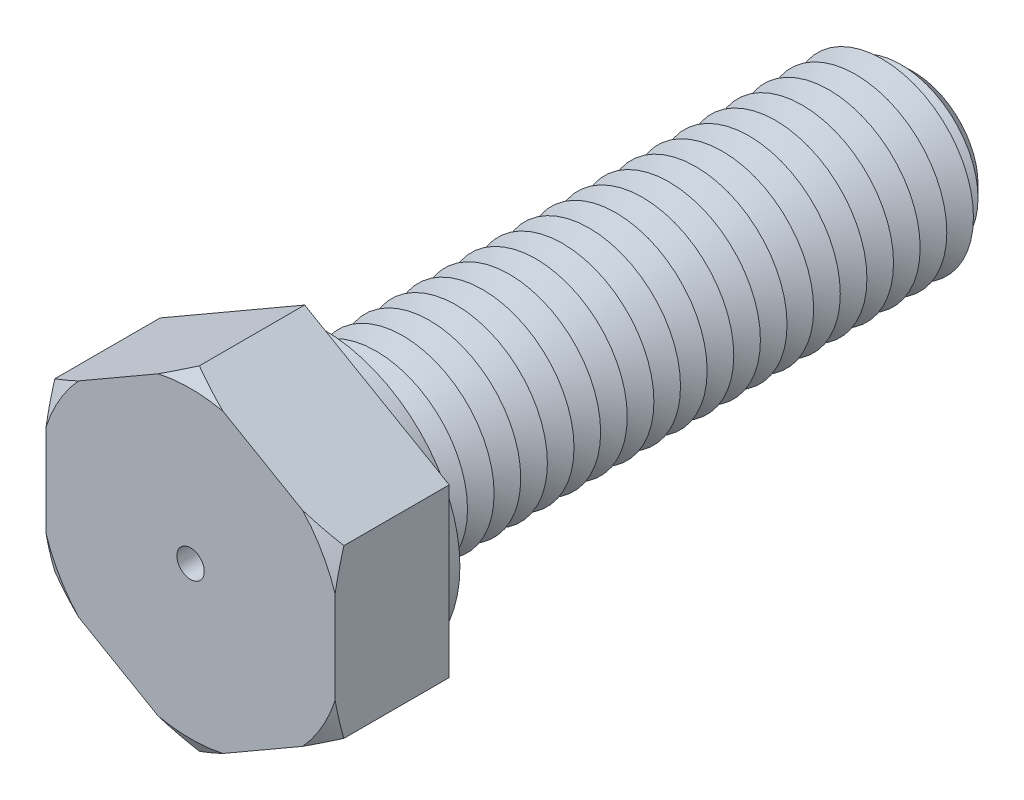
ISO-10303-21;
HEADER;
FILE_DESCRIPTION(('STEP AP214'),'2;1');
FILE_NAME('part.step','',(''),(''),'','','');
FILE_SCHEMA(('AUTOMOTIVE_DESIGN { 1 0 10303 214 1 1 1 1 }'));
ENDSEC;
DATA;
#1=APPLICATION_CONTEXT('core data for automotive mechanical design processes');
#2=APPLICATION_PROTOCOL_DEFINITION('international standard','automotive_design',2000,#1);
#3=PRODUCT_CONTEXT('',#1,'mechanical');
#4=PRODUCT('Part','Part','',(#3));
#5=PRODUCT_RELATED_PRODUCT_CATEGORY('part','',(#4));
#6=PRODUCT_DEFINITION_FORMATION('','',#4);
#7=PRODUCT_DEFINITION_CONTEXT('part definition',#1,'design');
#8=PRODUCT_DEFINITION('design','',#6,#7);
#9=PRODUCT_DEFINITION_SHAPE('','',#8);
#10=(LENGTH_UNIT() NAMED_UNIT(*) SI_UNIT(.MILLI.,.METRE.));
#11=(NAMED_UNIT(*) PLANE_ANGLE_UNIT() SI_UNIT($,.RADIAN.));
#12=(NAMED_UNIT(*) SI_UNIT($,.STERADIAN.) SOLID_ANGLE_UNIT());
#13=UNCERTAINTY_MEASURE_WITH_UNIT(LENGTH_MEASURE(1.E-05),#10,'distance_accuracy_value','');
#14=(GEOMETRIC_REPRESENTATION_CONTEXT(3) GLOBAL_UNCERTAINTY_ASSIGNED_CONTEXT((#13)) GLOBAL_UNIT_ASSIGNED_CONTEXT((#10,
#11,#12)) REPRESENTATION_CONTEXT('',''));
#15=CARTESIAN_POINT('',(0.,0.,0.));
#16=DIRECTION('',(0.,0.,1.));
#17=DIRECTION('',(1.,0.,0.));
#18=AXIS2_PLACEMENT_3D('',#15,#16,#17);
#19=CARTESIAN_POINT('',(9.5,5.48482755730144,7.5));
#20=DIRECTION('',(-0.5,-0.866025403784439,0.));
#21=DIRECTION('',(0.866025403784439,-0.5,0.));
#22=AXIS2_PLACEMENT_3D('',#19,#20,#21);
#23=PLANE('',#22);
#24=CARTESIAN_POINT('',(16.0911028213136,1.67945256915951,3.91531658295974));
#25=CARTESIAN_POINT('',(15.7926530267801,1.85176263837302,4.07633378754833));
#26=CARTESIAN_POINT('',(15.4934885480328,2.02448533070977,4.23561185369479));
#27=CARTESIAN_POINT('',(14.8934288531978,2.37092995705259,4.54987291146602));
#28=CARTESIAN_POINT('',(14.5925334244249,2.54465201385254,4.70485536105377));
#29=CARTESIAN_POINT('',(13.9878148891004,2.89378642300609,5.01015744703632));
#30=CARTESIAN_POINT('',(13.6839854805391,3.06920241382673,5.16046049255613));
#31=CARTESIAN_POINT('',(13.0740489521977,3.4213494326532,5.45475890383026));
#32=CARTESIAN_POINT('',(12.7679419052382,3.59808041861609,5.59875447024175));
#33=CARTESIAN_POINT('',(12.1452865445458,3.95757065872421,5.88261207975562));
#34=CARTESIAN_POINT('',(11.8286703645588,4.14036909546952,6.02227655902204));
#35=CARTESIAN_POINT('',(11.1922429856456,4.50781061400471,6.29164435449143));
#36=CARTESIAN_POINT('',(10.8724316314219,4.69245378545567,6.42134718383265));
#37=CARTESIAN_POINT('',(10.2295404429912,5.06362718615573,6.66831982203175));
#38=CARTESIAN_POINT('',(9.90646410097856,5.25015539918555,6.78560163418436));
#39=CARTESIAN_POINT('',(9.2565183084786,5.62540177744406,7.00502233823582));
#40=CARTESIAN_POINT('',(8.92964935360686,5.81411965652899,7.1071631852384));
#41=CARTESIAN_POINT('',(8.14786487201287,6.26548313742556,7.32807954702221));
#42=CARTESIAN_POINT('',(7.6911273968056,6.52918064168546,7.43861218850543));
#43=CARTESIAN_POINT('',(7.00135730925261,6.92741958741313,7.57140056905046));
#44=CARTESIAN_POINT('',(6.77066782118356,7.06060822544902,7.61016053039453));
#45=CARTESIAN_POINT('',(6.30799755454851,7.3277310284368,7.6757081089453));
#46=CARTESIAN_POINT('',(6.07601678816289,7.46166518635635,7.70249583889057));
#47=CARTESIAN_POINT('',(5.61390562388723,7.72846519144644,7.74308971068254));
#48=CARTESIAN_POINT('',(5.38378495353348,7.86132542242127,7.75704275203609));
#49=CARTESIAN_POINT('',(4.92322735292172,8.1272284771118,7.77208284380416));
#50=CARTESIAN_POINT('',(4.69279042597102,8.26027129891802,7.7731700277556));
#51=CARTESIAN_POINT('',(4.23214422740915,8.52622550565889,7.76244373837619));
#52=CARTESIAN_POINT('',(4.00193495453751,8.65913689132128,7.7506303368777));
#53=CARTESIAN_POINT('',(3.54223236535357,8.92454630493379,7.71446028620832));
#54=CARTESIAN_POINT('',(3.31273916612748,9.05704426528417,7.69010168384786));
#55=CARTESIAN_POINT('',(2.77042202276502,9.37015121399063,7.61833387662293));
#56=CARTESIAN_POINT('',(2.45810922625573,9.55046509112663,7.56573497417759));
#57=CARTESIAN_POINT('',(1.83647686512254,9.90936470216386,7.44074774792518));
#58=CARTESIAN_POINT('',(1.52715774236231,10.087950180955,7.36835654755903));
#59=CARTESIAN_POINT('',(0.911549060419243,10.4433720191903,7.20651778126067));
#60=CARTESIAN_POINT('',(0.605263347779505,10.6202061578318,7.1170509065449));
#61=CARTESIAN_POINT('',(-0.00386858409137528,10.9718886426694,6.92387899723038));
#62=CARTESIAN_POINT('',(-0.30671501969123,11.1467371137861,6.8201748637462));
#63=CARTESIAN_POINT('',(-0.912759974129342,11.496637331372,6.59968787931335));
#64=CARTESIAN_POINT('',(-1.21591973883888,11.6716667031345,6.48276398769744));
#65=CARTESIAN_POINT('',(-1.8190277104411,12.0198712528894,6.23911056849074));
#66=CARTESIAN_POINT('',(-2.11897790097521,12.1930475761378,6.11238754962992));
#67=CARTESIAN_POINT('',(-2.71614501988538,12.5378221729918,5.85087494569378));
#68=CARTESIAN_POINT('',(-3.01336251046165,12.7094207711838,5.71608706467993));
#69=CARTESIAN_POINT('',(-3.60546807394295,13.0512730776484,5.43985672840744));
#70=CARTESIAN_POINT('',(-3.90035610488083,13.2215267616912,5.29841415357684));
#71=CARTESIAN_POINT('',(-4.39671248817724,13.5080982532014,5.05486951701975));
#72=CARTESIAN_POINT('',(-4.59871463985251,13.624724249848,4.95421186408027));
#73=CARTESIAN_POINT('',(-5.00183994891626,13.8574687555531,4.75059724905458));
#74=CARTESIAN_POINT('',(-5.20296313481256,13.9735872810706,4.647640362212));
#75=CARTESIAN_POINT('',(-5.60231741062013,14.2041545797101,4.44078592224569));
#76=CARTESIAN_POINT('',(-5.80055672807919,14.3186081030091,4.33690951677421));
#77=CARTESIAN_POINT('',(-6.19633679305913,14.5471118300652,4.12738601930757));
#78=CARTESIAN_POINT('',(-6.39387752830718,14.6611620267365,4.02173889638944));
#79=CARTESIAN_POINT('',(-6.59110282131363,14.7750301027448,3.91531658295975));
#80=B_SPLINE_CURVE_WITH_KNOTS('',3,(#24,#25,#26,#27,#28,#29,#30,#31,#32,#33,#34,#35,#36,#37,#38,
#39,#40,#41,#42,#43,#44,#45,#46,#47,#48,#49,#50,#51,#52,#53,#54,#55,#56,#57,#58,#59,#60,#61,#62,
#63,#64,#65,#66,#67,#68,#69,#70,#71,#72,#73,#74,#75,#76,#77,#78,#79),.UNSPECIFIED.,.F.,.F.,(4,2,
2,2,2,2,2,2,2,2,2,2,2,2,2,2,2,2,2,2,2,2,2,2,2,2,2,4),(0.,1.14115474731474,2.28245284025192,
3.42741980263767,4.57235031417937,5.74632926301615,6.92036555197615,8.09325673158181,
9.26599632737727,10.8807998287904,11.6881240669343,12.4954407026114,13.2933978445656,
14.0913467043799,14.8892911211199,15.6873598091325,16.7800286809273,17.8728564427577,
18.9669273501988,20.0609290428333,21.1679585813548,22.2742590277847,23.380326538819,
24.4864139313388,25.2485345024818,26.010630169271,26.7647435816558,27.5188701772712),.UNSPECIFIED.);
#81=CARTESIAN_POINT('',(9.5,5.48482755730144,6.92264973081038));
#82=VERTEX_POINT('',#81);
#83=CARTESIAN_POINT('',(7.36878164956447,6.71528704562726,7.5));
#84=VERTEX_POINT('',#83);
#85=EDGE_CURVE('E132',#82,#84,#80,.T.);
#86=ORIENTED_EDGE('',*,*,#85,.F.);
#87=DIRECTION('',(0.,0.,-1.));
#88=VECTOR('',#87,1.);
#89=CARTESIAN_POINT('',(9.5,5.48482755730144,7.5));
#90=LINE('',#89,#88);
#91=CARTESIAN_POINT('',(9.5,5.48482755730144,0.));
#92=VERTEX_POINT('',#91);
#93=EDGE_CURVE('E144',#82,#92,#90,.T.);
#94=ORIENTED_EDGE('',*,*,#93,.T.);
#95=DIRECTION('',(-0.866025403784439,0.5,0.));
#96=VECTOR('',#95,1.);
#97=CARTESIAN_POINT('',(9.5,5.48482755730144,0.));
#98=LINE('',#97,#96);
#99=CARTESIAN_POINT('',(0.,10.9696551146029,0.));
#100=VERTEX_POINT('',#99);
#101=EDGE_CURVE('E380',#92,#100,#98,.T.);
#102=ORIENTED_EDGE('',*,*,#101,.T.);
#103=DIRECTION('',(0.,0.,-1.));
#104=VECTOR('',#103,1.);
#105=CARTESIAN_POINT('',(0.,10.9696551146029,7.5));
#106=LINE('',#105,#104);
#107=CARTESIAN_POINT('',(0.,10.9696551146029,6.92264973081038));
#108=VERTEX_POINT('',#107);
#109=EDGE_CURVE('E178',#108,#100,#106,.T.);
#110=ORIENTED_EDGE('',*,*,#109,.F.);
#111=CARTESIAN_POINT('',(2.13121835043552,9.73919562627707,7.5));
#112=VERTEX_POINT('',#111);
#113=EDGE_CURVE('E151',#112,#108,#80,.T.);
#114=ORIENTED_EDGE('',*,*,#113,.F.);
#115=DIRECTION('',(-0.866025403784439,0.5,0.));
#116=VECTOR('',#115,1.);
#117=CARTESIAN_POINT('',(9.5,5.48482755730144,7.5));
#118=LINE('',#117,#116);
#119=EDGE_CURVE('E148',#84,#112,#118,.T.);
#120=ORIENTED_EDGE('',*,*,#119,.F.);
#121=EDGE_LOOP('',(#86,#94,#102,#110,#114,#120));
#122=FACE_BOUND('',#121,.T.);
#123=ADVANCED_FACE('F39',(#122),#23,.F.);
#124=CARTESIAN_POINT('',(0.,10.9696551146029,7.5));
#125=DIRECTION('',(0.5,-0.866025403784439,0.));
#126=DIRECTION('',(0.866025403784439,0.5,0.));
#127=AXIS2_PLACEMENT_3D('',#124,#125,#126);
#128=PLANE('',#127);
#129=CARTESIAN_POINT('',(6.59110282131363,14.7750301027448,3.91531658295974));
#130=CARTESIAN_POINT('',(6.29265302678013,14.6027200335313,4.07633378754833));
#131=CARTESIAN_POINT('',(5.99348854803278,14.4299973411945,4.23561185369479));
#132=CARTESIAN_POINT('',(5.3934288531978,14.0835527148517,4.54987291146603));
#133=CARTESIAN_POINT('',(5.09253342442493,13.9098306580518,4.70485536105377));
#134=CARTESIAN_POINT('',(4.48781488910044,13.5606962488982,5.01015744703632));
#135=CARTESIAN_POINT('',(4.18398548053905,13.3852802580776,5.16046049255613));
#136=CARTESIAN_POINT('',(3.5740489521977,13.0331332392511,5.45475890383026));
#137=CARTESIAN_POINT('',(3.26794190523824,12.8564022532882,5.59875447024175));
#138=CARTESIAN_POINT('',(2.64528654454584,12.4969120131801,5.88261207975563));
#139=CARTESIAN_POINT('',(2.32867036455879,12.3141135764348,6.02227655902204));
#140=CARTESIAN_POINT('',(1.69224298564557,11.9466720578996,6.29164435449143));
#141=CARTESIAN_POINT('',(1.37243163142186,11.7620288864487,6.42134718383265));
#142=CARTESIAN_POINT('',(0.729540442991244,11.3908554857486,6.66831982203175));
#143=CARTESIAN_POINT('',(0.406464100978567,11.2043272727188,6.78560163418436));
#144=CARTESIAN_POINT('',(-0.243481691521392,10.8290808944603,7.00502233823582));
#145=CARTESIAN_POINT('',(-0.570350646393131,10.6403630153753,7.1071631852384));
#146=CARTESIAN_POINT('',(-1.35213512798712,10.1889995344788,7.32807954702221));
#147=CARTESIAN_POINT('',(-1.80887260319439,9.92530203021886,7.43861218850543));
#148=CARTESIAN_POINT('',(-2.49864269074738,9.52706308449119,7.57140056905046));
#149=CARTESIAN_POINT('',(-2.72933217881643,9.39387444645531,7.61016053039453));
#150=CARTESIAN_POINT('',(-3.19200244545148,9.12675164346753,7.6757081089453));
#151=CARTESIAN_POINT('',(-3.4239832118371,8.99281748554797,7.70249583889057));
#152=CARTESIAN_POINT('',(-3.88609437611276,8.72601748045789,7.74308971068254));
#153=CARTESIAN_POINT('',(-4.11621504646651,8.59315724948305,7.75704275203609));
#154=CARTESIAN_POINT('',(-4.57677264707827,8.32725419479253,7.77208284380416));
#155=CARTESIAN_POINT('',(-4.80720957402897,8.19421137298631,7.7731700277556));
#156=CARTESIAN_POINT('',(-5.26785577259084,7.92825716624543,7.76244373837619));
#157=CARTESIAN_POINT('',(-5.49806504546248,7.79534578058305,7.7506303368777));
#158=CARTESIAN_POINT('',(-5.95776763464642,7.52993636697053,7.71446028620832));
#159=CARTESIAN_POINT('',(-6.18726083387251,7.39743840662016,7.69010168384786));
#160=CARTESIAN_POINT('',(-6.72957797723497,7.0843314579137,7.61833387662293));
#161=CARTESIAN_POINT('',(-7.04189077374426,6.90401758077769,7.56573497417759));
#162=CARTESIAN_POINT('',(-7.66352313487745,6.54511796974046,7.44074774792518));
#163=CARTESIAN_POINT('',(-7.97284225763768,6.36653249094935,7.36835654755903));
#164=CARTESIAN_POINT('',(-8.58845093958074,6.01111065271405,7.20651778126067));
#165=CARTESIAN_POINT('',(-8.89473665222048,5.83427651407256,7.1170509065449));
#166=CARTESIAN_POINT('',(-9.50386858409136,5.48259402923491,6.92387899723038));
#167=CARTESIAN_POINT('',(-9.80671501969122,5.30774555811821,6.8201748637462));
#168=CARTESIAN_POINT('',(-10.4127599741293,4.95784534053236,6.59968787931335));
#169=CARTESIAN_POINT('',(-10.7159197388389,4.78281596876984,6.48276398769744));
#170=CARTESIAN_POINT('',(-11.3190277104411,4.43461141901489,6.23911056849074));
#171=CARTESIAN_POINT('',(-11.6189779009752,4.26143509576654,6.11238754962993));
#172=CARTESIAN_POINT('',(-12.2161450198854,3.91666049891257,5.85087494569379));
#173=CARTESIAN_POINT('',(-12.5133625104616,3.74506190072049,5.71608706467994));
#174=CARTESIAN_POINT('',(-13.1054680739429,3.40320959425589,5.43985672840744));
#175=CARTESIAN_POINT('',(-13.4003561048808,3.2329559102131,5.29841415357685));
#176=CARTESIAN_POINT('',(-13.8967124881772,2.94638441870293,5.05486951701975));
#177=CARTESIAN_POINT('',(-14.0987146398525,2.82975842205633,4.95421186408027));
#178=CARTESIAN_POINT('',(-14.5018399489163,2.59701391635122,4.75059724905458));
#179=CARTESIAN_POINT('',(-14.7029631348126,2.48089539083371,4.647640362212));
#180=CARTESIAN_POINT('',(-15.1023174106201,2.25032809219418,4.44078592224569));
#181=CARTESIAN_POINT('',(-15.3005567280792,2.13587456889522,4.33690951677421));
#182=CARTESIAN_POINT('',(-15.6963367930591,1.90737084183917,4.12738601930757));
#183=CARTESIAN_POINT('',(-15.8938775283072,1.79332064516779,4.02173889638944));
#184=CARTESIAN_POINT('',(-16.0911028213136,1.67945256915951,3.91531658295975));
#185=B_SPLINE_CURVE_WITH_KNOTS('',3,(#129,#130,#131,#132,#133,#134,#135,#136,#137,#138,#139,
#140,#141,#142,#143,#144,#145,#146,#147,#148,#149,#150,#151,#152,#153,#154,#155,#156,#157,#158,
#159,#160,#161,#162,#163,#164,#165,#166,#167,#168,#169,#170,#171,#172,#173,#174,#175,#176,#177,
#178,#179,#180,#181,#182,#183,#184),.UNSPECIFIED.,.F.,.F.,(4,2,2,2,2,2,2,2,2,2,2,2,2,2,2,2,2,2,
2,2,2,2,2,2,2,2,2,4),(0.,1.14115474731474,2.28245284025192,3.42741980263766,4.57235031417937,
5.74632926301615,6.92036555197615,8.09325673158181,9.26599632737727,10.8807998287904,
11.6881240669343,12.4954407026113,13.2933978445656,14.0913467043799,14.8892911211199,
15.6873598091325,16.7800286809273,17.8728564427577,18.9669273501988,20.0609290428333,
21.1679585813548,22.2742590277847,23.380326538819,24.4864139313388,25.2485345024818,
26.010630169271,26.7647435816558,27.5188701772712),.UNSPECIFIED.);
#186=CARTESIAN_POINT('',(-2.13121835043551,9.73919562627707,7.5));
#187=VERTEX_POINT('',#186);
#188=EDGE_CURVE('E1148',#108,#187,#185,.T.);
#189=ORIENTED_EDGE('',*,*,#188,.F.);
#190=ORIENTED_EDGE('',*,*,#109,.T.);
#191=DIRECTION('',(-0.866025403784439,-0.5,0.));
#192=VECTOR('',#191,1.);
#193=CARTESIAN_POINT('',(0.,10.9696551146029,0.));
#194=LINE('',#193,#192);
#195=CARTESIAN_POINT('',(-9.5,5.48482755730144,0.));
#196=VERTEX_POINT('',#195);
#197=EDGE_CURVE('E399',#100,#196,#194,.T.);
#198=ORIENTED_EDGE('',*,*,#197,.T.);
#199=DIRECTION('',(0.,0.,-1.));
#200=VECTOR('',#199,1.);
#201=CARTESIAN_POINT('',(-9.5,5.48482755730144,7.5));
#202=LINE('',#201,#200);
#203=CARTESIAN_POINT('',(-9.5,5.48482755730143,6.92264973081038));
#204=VERTEX_POINT('',#203);
#205=EDGE_CURVE('E175',#204,#196,#202,.T.);
#206=ORIENTED_EDGE('',*,*,#205,.F.);
#207=CARTESIAN_POINT('',(-7.36878164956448,6.71528704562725,7.5));
#208=VERTEX_POINT('',#207);
#209=EDGE_CURVE('E468',#208,#204,#185,.T.);
#210=ORIENTED_EDGE('',*,*,#209,.F.);
#211=DIRECTION('',(-0.866025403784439,-0.5,0.));
#212=VECTOR('',#211,1.);
#213=CARTESIAN_POINT('',(0.,10.9696551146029,7.5));
#214=LINE('',#213,#212);
#215=EDGE_CURVE('E383',#187,#208,#214,.T.);
#216=ORIENTED_EDGE('',*,*,#215,.F.);
#217=EDGE_LOOP('',(#189,#190,#198,#206,#210,#216));
#218=FACE_BOUND('',#217,.T.);
#219=ADVANCED_FACE('F477',(#218),#128,.F.);
#220=CARTESIAN_POINT('',(-9.5,5.48482755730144,7.5));
#221=DIRECTION('',(1.,0.,0.));
#222=DIRECTION('',(0.,1.,0.));
#223=AXIS2_PLACEMENT_3D('',#220,#221,#222);
#224=PLANE('',#223);
#225=CARTESIAN_POINT('',(-9.5,12.0759303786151,4.38509256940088));
#226=CARTESIAN_POINT('',(-9.5,11.7327439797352,4.5407773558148));
#227=CARTESIAN_POINT('',(-9.5,11.388618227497,4.69443095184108));
#228=CARTESIAN_POINT('',(-9.5,10.698085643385,4.99669009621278));
#229=CARTESIAN_POINT('',(-9.5,10.3516784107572,5.1452947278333));
#230=CARTESIAN_POINT('',(-9.5,9.65484997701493,5.43702212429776));
#231=CARTESIAN_POINT('',(-9.5,9.30441804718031,5.58011936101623));
#232=CARTESIAN_POINT('',(-9.5,8.60059023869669,5.85880989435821));
#233=CARTESIAN_POINT('',(-9.5,8.24719449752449,5.9944035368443));
#234=CARTESIAN_POINT('',(-9.5,7.53860340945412,6.25582574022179));
#235=CARTESIAN_POINT('',(-9.5,7.18342337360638,6.38169559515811));
#236=CARTESIAN_POINT('',(-9.5,6.46926569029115,6.62229858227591));
#237=CARTESIAN_POINT('',(-9.5,6.11028785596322,6.73703116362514));
#238=CARTESIAN_POINT('',(-9.5,5.38872372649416,6.95272419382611));
#239=CARTESIAN_POINT('',(-9.5,5.02614305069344,7.05370330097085));
#240=CARTESIAN_POINT('',(-9.5,4.29675196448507,7.23920160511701));
#241=CARTESIAN_POINT('',(-9.5,3.92994173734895,7.32372151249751));
#242=CARTESIAN_POINT('',(-9.5,3.29665308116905,7.45205940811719));
#243=CARTESIAN_POINT('',(-9.5,3.03113701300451,7.50062833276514));
#244=CARTESIAN_POINT('',(-9.5,2.49832809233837,7.5865841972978));
#245=CARTESIAN_POINT('',(-9.5,2.23103554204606,7.62397299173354));
#246=CARTESIAN_POINT('',(-9.5,1.69506861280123,7.68659004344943));
#247=CARTESIAN_POINT('',(-9.5,1.42639449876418,7.71182055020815));
#248=CARTESIAN_POINT('',(-9.5,0.888138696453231,7.74939803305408));
#249=CARTESIAN_POINT('',(-9.5,0.618557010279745,7.76174503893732));
#250=CARTESIAN_POINT('',(-9.5,0.0792458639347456,7.77317034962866));
#251=CARTESIAN_POINT('',(-9.5,-0.190483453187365,7.77225534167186));
#252=CARTESIAN_POINT('',(-9.5,-0.729567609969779,7.75720205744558));
#253=CARTESIAN_POINT('',(-9.5,-0.998922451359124,7.74306384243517));
#254=CARTESIAN_POINT('',(-9.5,-1.53667618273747,7.70199575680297));
#255=CARTESIAN_POINT('',(-9.5,-1.80507496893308,7.67506453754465));
#256=CARTESIAN_POINT('',(-9.5,-2.34038611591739,7.60918517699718));
#257=CARTESIAN_POINT('',(-9.5,-2.60729841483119,7.57023653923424));
#258=CARTESIAN_POINT('',(-9.5,-3.27166409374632,7.45918941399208));
#259=CARTESIAN_POINT('',(-9.5,-3.66797754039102,7.38023980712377));
#260=CARTESIAN_POINT('',(-9.5,-4.45585575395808,7.20141943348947));
#261=CARTESIAN_POINT('',(-9.5,-4.8474194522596,7.10154404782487));
#262=CARTESIAN_POINT('',(-9.5,-5.6265713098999,6.88438943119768));
#263=CARTESIAN_POINT('',(-9.5,-6.01414884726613,6.76707245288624));
#264=CARTESIAN_POINT('',(-9.5,-6.78474185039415,6.51851091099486));
#265=CARTESIAN_POINT('',(-9.5,-7.16775763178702,6.38726731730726));
#266=CARTESIAN_POINT('',(-9.5,-7.93407213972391,6.11202298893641));
#267=CARTESIAN_POINT('',(-9.5,-8.31732458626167,5.96789419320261));
#268=CARTESIAN_POINT('',(-9.5,-9.08024927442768,5.67043108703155));
#269=CARTESIAN_POINT('',(-9.5,-9.4599212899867,5.51709619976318));
#270=CARTESIAN_POINT('',(-9.5,-10.2138362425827,5.20397874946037));
#271=CARTESIAN_POINT('',(-9.5,-10.5880982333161,5.04424191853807));
#272=CARTESIAN_POINT('',(-9.5,-11.1474871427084,4.80018423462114));
#273=CARTESIAN_POINT('',(-9.5,-11.3335947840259,4.71809930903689));
#274=CARTESIAN_POINT('',(-9.5,-11.7052038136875,4.55257683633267));
#275=CARTESIAN_POINT('',(-9.5,-11.8907052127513,4.46913931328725));
#276=CARTESIAN_POINT('',(-9.5,-12.0759303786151,4.38509256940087));
#277=B_SPLINE_CURVE_WITH_KNOTS('',3,(#225,#226,#227,#228,#229,#230,#231,#232,#233,#234,#235,
#236,#237,#238,#239,#240,#241,#242,#243,#244,#245,#246,#247,#248,#249,#250,#251,#252,#253,#254,
#255,#256,#257,#258,#259,#260,#261,#262,#263,#264,#265,#266,#267,#268,#269,#270,#271,#272,#273,
#274,#275,#276),.UNSPECIFIED.,.F.,.F.,(4,2,2,2,2,2,2,2,2,2,2,2,2,2,2,2,2,2,2,2,2,2,2,2,2,4),(0.,
1.13056270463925,2.26132959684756,3.39682602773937,4.53227007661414,5.66259174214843,
6.79296928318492,7.92179771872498,9.0505774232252,9.86013572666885,10.6695596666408,
11.4788337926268,12.288106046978,13.0969702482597,13.9058307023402,14.7147764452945,
15.5237556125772,16.7353316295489,17.9471753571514,19.1616810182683,20.3761021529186,
21.6043286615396,22.8326322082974,24.0533405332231,24.6635541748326,25.273756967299),.UNSPECIFIED.);
#278=CARTESIAN_POINT('',(-9.5,3.02390858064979,7.5));
#279=VERTEX_POINT('',#278);
#280=EDGE_CURVE('E466',#204,#279,#277,.T.);
#281=ORIENTED_EDGE('',*,*,#280,.F.);
#282=ORIENTED_EDGE('',*,*,#205,.T.);
#283=DIRECTION('',(0.,-1.,0.));
#284=VECTOR('',#283,1.);
#285=CARTESIAN_POINT('',(-9.5,5.48482755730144,0.));
#286=LINE('',#285,#284);
#287=CARTESIAN_POINT('',(-9.5,-5.48482755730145,0.));
#288=VERTEX_POINT('',#287);
#289=EDGE_CURVE('E403',#196,#288,#286,.T.);
#290=ORIENTED_EDGE('',*,*,#289,.T.);
#291=DIRECTION('',(0.,0.,-1.));
#292=VECTOR('',#291,1.);
#293=CARTESIAN_POINT('',(-9.5,-5.48482755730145,7.5));
#294=LINE('',#293,#292);
#295=CARTESIAN_POINT('',(-9.49999999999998,-5.48482755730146,6.92264973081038));
#296=VERTEX_POINT('',#295);
#297=EDGE_CURVE('E172',#296,#288,#294,.T.);
#298=ORIENTED_EDGE('',*,*,#297,.F.);
#299=CARTESIAN_POINT('',(-9.5,-3.02390858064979,7.5));
#300=VERTEX_POINT('',#299);
#301=EDGE_CURVE('E460',#300,#296,#277,.T.);
#302=ORIENTED_EDGE('',*,*,#301,.F.);
#303=DIRECTION('',(0.,-1.,0.));
#304=VECTOR('',#303,1.);
#305=CARTESIAN_POINT('',(-9.5,5.48482755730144,7.5));
#306=LINE('',#305,#304);
#307=EDGE_CURVE('E387',#279,#300,#306,.T.);
#308=ORIENTED_EDGE('',*,*,#307,.F.);
#309=EDGE_LOOP('',(#281,#282,#290,#298,#302,#308));
#310=FACE_BOUND('',#309,.T.);
#311=ADVANCED_FACE('F473',(#310),#224,.F.);
#312=CARTESIAN_POINT('',(-9.5,-5.48482755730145,7.5));
#313=DIRECTION('',(0.5,0.866025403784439,0.));
#314=DIRECTION('',(-0.866025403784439,0.5,0.));
#315=AXIS2_PLACEMENT_3D('',#312,#313,#314);
#316=PLANE('',#315);
#317=CARTESIAN_POINT('',(-16.0911028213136,-1.67945256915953,3.91531658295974));
#318=CARTESIAN_POINT('',(-15.7926530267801,-1.85176263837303,4.07633378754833));
#319=CARTESIAN_POINT('',(-15.4934885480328,-2.02448533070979,4.23561185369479));
#320=CARTESIAN_POINT('',(-14.8934288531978,-2.37092995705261,4.54987291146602));
#321=CARTESIAN_POINT('',(-14.5925334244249,-2.54465201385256,4.70485536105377));
#322=CARTESIAN_POINT('',(-13.9878148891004,-2.89378642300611,5.01015744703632));
#323=CARTESIAN_POINT('',(-13.683985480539,-3.06920241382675,5.16046049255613));
#324=CARTESIAN_POINT('',(-13.0740489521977,-3.42134943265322,5.45475890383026));
#325=CARTESIAN_POINT('',(-12.7679419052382,-3.5980804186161,5.59875447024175));
#326=CARTESIAN_POINT('',(-12.1452865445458,-3.95757065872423,5.88261207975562));
#327=CARTESIAN_POINT('',(-11.8286703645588,-4.14036909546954,6.02227655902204));
#328=CARTESIAN_POINT('',(-11.1922429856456,-4.50781061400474,6.29164435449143));
#329=CARTESIAN_POINT('',(-10.8724316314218,-4.69245378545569,6.42134718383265));
#330=CARTESIAN_POINT('',(-10.2295404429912,-5.06362718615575,6.66831982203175));
#331=CARTESIAN_POINT('',(-9.90646410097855,-5.25015539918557,6.78560163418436));
#332=CARTESIAN_POINT('',(-9.25651830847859,-5.62540177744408,7.00502233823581));
#333=CARTESIAN_POINT('',(-8.92964935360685,-5.81411965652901,7.1071631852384));
#334=CARTESIAN_POINT('',(-8.14786487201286,-6.26548313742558,7.32807954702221));
#335=CARTESIAN_POINT('',(-7.69112739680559,-6.52918064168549,7.43861218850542));
#336=CARTESIAN_POINT('',(-7.0013573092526,-6.92741958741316,7.57140056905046));
#337=CARTESIAN_POINT('',(-6.77066782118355,-7.06060822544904,7.61016053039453));
#338=CARTESIAN_POINT('',(-6.3079975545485,-7.32773102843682,7.6757081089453));
#339=CARTESIAN_POINT('',(-6.07601678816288,-7.46166518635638,7.70249583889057));
#340=CARTESIAN_POINT('',(-5.61390562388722,-7.72846519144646,7.74308971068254));
#341=CARTESIAN_POINT('',(-5.38378495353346,-7.8613254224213,7.75704275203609));
#342=CARTESIAN_POINT('',(-4.9232273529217,-8.12722847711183,7.77208284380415));
#343=CARTESIAN_POINT('',(-4.692790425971,-8.26027129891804,7.77317002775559));
#344=CARTESIAN_POINT('',(-4.23214422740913,-8.52622550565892,7.76244373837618));
#345=CARTESIAN_POINT('',(-4.00193495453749,-8.6591368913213,7.75063033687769));
#346=CARTESIAN_POINT('',(-3.54223236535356,-8.92454630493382,7.71446028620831));
#347=CARTESIAN_POINT('',(-3.31273916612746,-9.05704426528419,7.69010168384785));
#348=CARTESIAN_POINT('',(-2.770422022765,-9.37015121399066,7.61833387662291));
#349=CARTESIAN_POINT('',(-2.45810922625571,-9.55046509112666,7.56573497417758));
#350=CARTESIAN_POINT('',(-1.83647686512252,-9.9093647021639,7.44074774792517));
#351=CARTESIAN_POINT('',(-1.52715774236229,-10.087950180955,7.36835654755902));
#352=CARTESIAN_POINT('',(-0.911549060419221,-10.4433720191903,7.20651778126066));
#353=CARTESIAN_POINT('',(-0.605263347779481,-10.6202061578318,7.11705090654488));
#354=CARTESIAN_POINT('',(0.00386858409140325,-10.9718886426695,6.92387899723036));
#355=CARTESIAN_POINT('',(0.30671501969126,-11.1467371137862,6.82017486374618));
#356=CARTESIAN_POINT('',(0.912759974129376,-11.496637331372,6.59968787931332));
#357=CARTESIAN_POINT('',(1.21591973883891,-11.6716667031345,6.48276398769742));
#358=CARTESIAN_POINT('',(1.81902771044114,-12.0198712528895,6.23911056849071));
#359=CARTESIAN_POINT('',(2.11897790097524,-12.1930475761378,6.11238754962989));
#360=CARTESIAN_POINT('',(2.71614501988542,-12.5378221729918,5.85087494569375));
#361=CARTESIAN_POINT('',(3.01336251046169,-12.7094207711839,5.7160870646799));
#362=CARTESIAN_POINT('',(3.60546807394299,-13.0512730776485,5.4398567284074));
#363=CARTESIAN_POINT('',(3.90035610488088,-13.2215267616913,5.29841415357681));
#364=CARTESIAN_POINT('',(4.39671248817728,-13.5080982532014,5.05486951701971));
#365=CARTESIAN_POINT('',(4.59871463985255,-13.624724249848,4.95421186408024));
#366=CARTESIAN_POINT('',(5.00183994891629,-13.8574687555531,4.75059724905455));
#367=CARTESIAN_POINT('',(5.20296313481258,-13.9735872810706,4.64764036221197));
#368=CARTESIAN_POINT('',(5.60231741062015,-14.2041545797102,4.44078592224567));
#369=CARTESIAN_POINT('',(5.8005567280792,-14.3186081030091,4.33690951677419));
#370=CARTESIAN_POINT('',(6.19633679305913,-14.5471118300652,4.12738601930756));
#371=CARTESIAN_POINT('',(6.39387752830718,-14.6611620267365,4.02173889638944));
#372=CARTESIAN_POINT('',(6.59110282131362,-14.7750301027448,3.91531658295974));
#373=B_SPLINE_CURVE_WITH_KNOTS('',3,(#317,#318,#319,#320,#321,#322,#323,#324,#325,#326,#327,
#328,#329,#330,#331,#332,#333,#334,#335,#336,#337,#338,#339,#340,#341,#342,#343,#344,#345,#346,
#347,#348,#349,#350,#351,#352,#353,#354,#355,#356,#357,#358,#359,#360,#361,#362,#363,#364,#365,
#366,#367,#368,#369,#370,#371,#372),.UNSPECIFIED.,.F.,.F.,(4,2,2,2,2,2,2,2,2,2,2,2,2,2,2,2,2,2,
2,2,2,2,2,2,2,2,2,4),(0.,1.14115474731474,2.28245284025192,3.42741980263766,4.57235031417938,
5.74632926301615,6.92036555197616,8.09325673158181,9.26599632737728,10.8807998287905,
11.6881240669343,12.4954407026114,13.2933978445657,14.0913467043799,14.8892911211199,
15.6873598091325,16.7800286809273,17.8728564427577,18.9669273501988,20.0609290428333,
21.1679585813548,22.2742590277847,23.3803265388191,24.4864139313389,25.2485345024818,
26.010630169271,26.7647435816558,27.5188701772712),.UNSPECIFIED.);
#374=CARTESIAN_POINT('',(-7.36878164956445,-6.71528704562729,7.5));
#375=VERTEX_POINT('',#374);
#376=EDGE_CURVE('E467',#296,#375,#373,.T.);
#377=ORIENTED_EDGE('',*,*,#376,.F.);
#378=ORIENTED_EDGE('',*,*,#297,.T.);
#379=DIRECTION('',(0.866025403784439,-0.5,0.));
#380=VECTOR('',#379,1.);
#381=CARTESIAN_POINT('',(-9.5,-5.48482755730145,0.));
#382=LINE('',#381,#380);
#383=CARTESIAN_POINT('',(0.,-10.9696551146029,0.));
#384=VERTEX_POINT('',#383);
#385=EDGE_CURVE('E407',#288,#384,#382,.T.);
#386=ORIENTED_EDGE('',*,*,#385,.T.);
#387=DIRECTION('',(0.,0.,-1.));
#388=VECTOR('',#387,1.);
#389=CARTESIAN_POINT('',(0.,-10.9696551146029,7.5));
#390=LINE('',#389,#388);
#391=CARTESIAN_POINT('',(0.,-10.9696551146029,6.92264973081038));
#392=VERTEX_POINT('',#391);
#393=EDGE_CURVE('E162',#392,#384,#390,.T.);
#394=ORIENTED_EDGE('',*,*,#393,.F.);
#395=CARTESIAN_POINT('',(-2.13121835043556,-9.73919562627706,7.5));
#396=VERTEX_POINT('',#395);
#397=EDGE_CURVE('E422',#396,#392,#373,.T.);
#398=ORIENTED_EDGE('',*,*,#397,.F.);
#399=DIRECTION('',(0.866025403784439,-0.5,0.));
#400=VECTOR('',#399,1.);
#401=CARTESIAN_POINT('',(-9.5,-5.48482755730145,7.5));
#402=LINE('',#401,#400);
#403=EDGE_CURVE('E390',#375,#396,#402,.T.);
#404=ORIENTED_EDGE('',*,*,#403,.F.);
#405=EDGE_LOOP('',(#377,#378,#386,#394,#398,#404));
#406=FACE_BOUND('',#405,.T.);
#407=ADVANCED_FACE('F476',(#406),#316,.F.);
#408=CARTESIAN_POINT('',(0.,-10.9696551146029,7.5));
#409=DIRECTION('',(-0.5,0.866025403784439,0.));
#410=DIRECTION('',(-0.866025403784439,-0.5,0.));
#411=AXIS2_PLACEMENT_3D('',#408,#409,#410);
#412=PLANE('',#411);
#413=CARTESIAN_POINT('',(-6.59110282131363,-14.7750301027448,3.91531658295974));
#414=CARTESIAN_POINT('',(-6.29265302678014,-14.6027200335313,4.07633378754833));
#415=CARTESIAN_POINT('',(-5.99348854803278,-14.4299973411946,4.23561185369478));
#416=CARTESIAN_POINT('',(-5.3934288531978,-14.0835527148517,4.54987291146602));
#417=CARTESIAN_POINT('',(-5.09253342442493,-13.9098306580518,4.70485536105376));
#418=CARTESIAN_POINT('',(-4.48781488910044,-13.5606962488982,5.01015744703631));
#419=CARTESIAN_POINT('',(-4.18398548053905,-13.3852802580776,5.16046049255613));
#420=CARTESIAN_POINT('',(-3.5740489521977,-13.0331332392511,5.45475890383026));
#421=CARTESIAN_POINT('',(-3.26794190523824,-12.8564022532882,5.59875447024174));
#422=CARTESIAN_POINT('',(-2.64528654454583,-12.4969120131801,5.88261207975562));
#423=CARTESIAN_POINT('',(-2.32867036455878,-12.3141135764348,6.02227655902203));
#424=CARTESIAN_POINT('',(-1.69224298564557,-11.9466720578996,6.29164435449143));
#425=CARTESIAN_POINT('',(-1.37243163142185,-11.7620288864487,6.42134718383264));
#426=CARTESIAN_POINT('',(-0.729540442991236,-11.3908554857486,6.66831982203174));
#427=CARTESIAN_POINT('',(-0.406464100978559,-11.2043272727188,6.78560163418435));
#428=CARTESIAN_POINT('',(0.243481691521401,-10.8290808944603,7.00502233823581));
#429=CARTESIAN_POINT('',(0.570350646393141,-10.6403630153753,7.10716318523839));
#430=CARTESIAN_POINT('',(1.35213512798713,-10.1889995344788,7.3280795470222));
#431=CARTESIAN_POINT('',(1.8088726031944,-9.92530203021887,7.43861218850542));
#432=CARTESIAN_POINT('',(2.49864269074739,-9.5270630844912,7.57140056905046));
#433=CARTESIAN_POINT('',(2.72933217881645,-9.39387444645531,7.61016053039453));
#434=CARTESIAN_POINT('',(3.19200244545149,-9.12675164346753,7.6757081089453));
#435=CARTESIAN_POINT('',(3.42398321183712,-8.99281748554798,7.70249583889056));
#436=CARTESIAN_POINT('',(3.88609437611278,-8.72601748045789,7.74308971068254));
#437=CARTESIAN_POINT('',(4.11621504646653,-8.59315724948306,7.75704275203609));
#438=CARTESIAN_POINT('',(4.57677264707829,-8.32725419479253,7.77208284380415));
#439=CARTESIAN_POINT('',(4.80720957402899,-8.19421137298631,7.77317002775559));
#440=CARTESIAN_POINT('',(5.26785577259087,-7.92825716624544,7.76244373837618));
#441=CARTESIAN_POINT('',(5.4980650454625,-7.79534578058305,7.75063033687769));
#442=CARTESIAN_POINT('',(5.95776763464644,-7.52993636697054,7.71446028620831));
#443=CARTESIAN_POINT('',(6.18726083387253,-7.39743840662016,7.69010168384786));
#444=CARTESIAN_POINT('',(6.72957797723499,-7.0843314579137,7.61833387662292));
#445=CARTESIAN_POINT('',(7.04189077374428,-6.9040175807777,7.56573497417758));
#446=CARTESIAN_POINT('',(7.66352313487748,-6.54511796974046,7.44074774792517));
#447=CARTESIAN_POINT('',(7.97284225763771,-6.36653249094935,7.36835654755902));
#448=CARTESIAN_POINT('',(8.58845093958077,-6.01111065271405,7.20651778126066));
#449=CARTESIAN_POINT('',(8.89473665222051,-5.83427651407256,7.11705090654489));
#450=CARTESIAN_POINT('',(9.50386858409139,-5.48259402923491,6.92387899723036));
#451=CARTESIAN_POINT('',(9.80671501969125,-5.30774555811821,6.82017486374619));
#452=CARTESIAN_POINT('',(10.4127599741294,-4.95784534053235,6.59968787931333));
#453=CARTESIAN_POINT('',(10.7159197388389,-4.78281596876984,6.48276398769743));
#454=CARTESIAN_POINT('',(11.3190277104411,-4.43461141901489,6.23911056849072));
#455=CARTESIAN_POINT('',(11.6189779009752,-4.26143509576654,6.1123875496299));
#456=CARTESIAN_POINT('',(12.2161450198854,-3.91666049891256,5.85087494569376));
#457=CARTESIAN_POINT('',(12.5133625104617,-3.74506190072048,5.71608706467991));
#458=CARTESIAN_POINT('',(13.105468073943,-3.40320959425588,5.43985672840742));
#459=CARTESIAN_POINT('',(13.4003561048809,-3.23295591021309,5.29841415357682));
#460=CARTESIAN_POINT('',(13.8967124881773,-2.94638441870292,5.05486951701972));
#461=CARTESIAN_POINT('',(14.0987146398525,-2.82975842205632,4.95421186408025));
#462=CARTESIAN_POINT('',(14.5018399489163,-2.59701391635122,4.75059724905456));
#463=CARTESIAN_POINT('',(14.7029631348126,-2.48089539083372,4.64764036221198));
#464=CARTESIAN_POINT('',(15.1023174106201,-2.25032809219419,4.44078592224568));
#465=CARTESIAN_POINT('',(15.3005567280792,-2.13587456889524,4.3369095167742));
#466=CARTESIAN_POINT('',(15.6963367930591,-1.90737084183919,4.12738601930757));
#467=CARTESIAN_POINT('',(15.8938775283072,-1.79332064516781,4.02173889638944));
#468=CARTESIAN_POINT('',(16.0911028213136,-1.67945256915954,3.91531658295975));
#469=B_SPLINE_CURVE_WITH_KNOTS('',3,(#413,#414,#415,#416,#417,#418,#419,#420,#421,#422,#423,
#424,#425,#426,#427,#428,#429,#430,#431,#432,#433,#434,#435,#436,#437,#438,#439,#440,#441,#442,
#443,#444,#445,#446,#447,#448,#449,#450,#451,#452,#453,#454,#455,#456,#457,#458,#459,#460,#461,
#462,#463,#464,#465,#466,#467,#468),.UNSPECIFIED.,.F.,.F.,(4,2,2,2,2,2,2,2,2,2,2,2,2,2,2,2,2,2,
2,2,2,2,2,2,2,2,2,4),(0.,1.14115474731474,2.28245284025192,3.42741980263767,4.57235031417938,
5.74632926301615,6.92036555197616,8.09325673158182,9.26599632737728,10.8807998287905,
11.6881240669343,12.4954407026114,13.2933978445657,14.0913467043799,14.8892911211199,
15.6873598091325,16.7800286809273,17.8728564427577,18.9669273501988,20.0609290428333,
21.1679585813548,22.2742590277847,23.3803265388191,24.4864139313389,25.2485345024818,
26.010630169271,26.7647435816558,27.5188701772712),.UNSPECIFIED.);
#470=CARTESIAN_POINT('',(2.13121835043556,-9.73919562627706,7.5));
#471=VERTEX_POINT('',#470);
#472=EDGE_CURVE('E64',#392,#471,#469,.T.);
#473=ORIENTED_EDGE('',*,*,#472,.F.);
#474=ORIENTED_EDGE('',*,*,#393,.T.);
#475=DIRECTION('',(0.866025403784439,0.5,0.));
#476=VECTOR('',#475,1.);
#477=CARTESIAN_POINT('',(0.,-10.9696551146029,0.));
#478=LINE('',#477,#476);
#479=CARTESIAN_POINT('',(9.5,-5.48482755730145,0.));
#480=VERTEX_POINT('',#479);
#481=EDGE_CURVE('E410',#384,#480,#478,.T.);
#482=ORIENTED_EDGE('',*,*,#481,.T.);
#483=DIRECTION('',(0.,0.,-1.));
#484=VECTOR('',#483,1.);
#485=CARTESIAN_POINT('',(9.5,-5.48482755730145,7.5));
#486=LINE('',#485,#484);
#487=CARTESIAN_POINT('',(9.5,-5.48482755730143,6.92264973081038));
#488=VERTEX_POINT('',#487);
#489=EDGE_CURVE('E157',#488,#480,#486,.T.);
#490=ORIENTED_EDGE('',*,*,#489,.F.);
#491=CARTESIAN_POINT('',(7.36878164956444,-6.71528704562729,7.5));
#492=VERTEX_POINT('',#491);
#493=EDGE_CURVE('E418',#492,#488,#469,.T.);
#494=ORIENTED_EDGE('',*,*,#493,.F.);
#495=DIRECTION('',(0.866025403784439,0.5,0.));
#496=VECTOR('',#495,1.);
#497=CARTESIAN_POINT('',(0.,-10.9696551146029,7.5));
#498=LINE('',#497,#496);
#499=EDGE_CURVE('E165',#471,#492,#498,.T.);
#500=ORIENTED_EDGE('',*,*,#499,.F.);
#501=EDGE_LOOP('',(#473,#474,#482,#490,#494,#500));
#502=FACE_BOUND('',#501,.T.);
#503=ADVANCED_FACE('F438',(#502),#412,.F.);
#504=CARTESIAN_POINT('',(9.5,-5.48482755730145,7.5));
#505=DIRECTION('',(-1.,0.,0.));
#506=DIRECTION('',(0.,-1.,0.));
#507=AXIS2_PLACEMENT_3D('',#504,#505,#506);
#508=PLANE('',#507);
#509=CARTESIAN_POINT('',(9.5,-12.0759303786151,4.38509256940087));
#510=CARTESIAN_POINT('',(9.5,-11.7327439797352,4.54077735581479));
#511=CARTESIAN_POINT('',(9.5,-11.388618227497,4.69443095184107));
#512=CARTESIAN_POINT('',(9.5,-10.698085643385,4.99669009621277));
#513=CARTESIAN_POINT('',(9.5,-10.3516784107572,5.14529472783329));
#514=CARTESIAN_POINT('',(9.5,-9.65484997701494,5.43702212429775));
#515=CARTESIAN_POINT('',(9.5,-9.30441804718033,5.58011936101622));
#516=CARTESIAN_POINT('',(9.5,-8.60059023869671,5.8588098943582));
#517=CARTESIAN_POINT('',(9.5,-8.2471944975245,5.99440353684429));
#518=CARTESIAN_POINT('',(9.5,-7.53860340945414,6.25582574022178));
#519=CARTESIAN_POINT('',(9.5,-7.18342337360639,6.3816955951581));
#520=CARTESIAN_POINT('',(9.5,-6.46926569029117,6.6222985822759));
#521=CARTESIAN_POINT('',(9.5,-6.11028785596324,6.73703116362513));
#522=CARTESIAN_POINT('',(9.5,-5.38872372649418,6.95272419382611));
#523=CARTESIAN_POINT('',(9.5,-5.02614305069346,7.05370330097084));
#524=CARTESIAN_POINT('',(9.5,-4.29675196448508,7.239201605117));
#525=CARTESIAN_POINT('',(9.5,-3.92994173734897,7.32372151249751));
#526=CARTESIAN_POINT('',(9.5,-3.29665308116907,7.45205940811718));
#527=CARTESIAN_POINT('',(9.5,-3.03113701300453,7.50062833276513));
#528=CARTESIAN_POINT('',(9.5,-2.49832809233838,7.5865841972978));
#529=CARTESIAN_POINT('',(9.5,-2.23103554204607,7.62397299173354));
#530=CARTESIAN_POINT('',(9.5,-1.69506861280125,7.68659004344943));
#531=CARTESIAN_POINT('',(9.5,-1.4263944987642,7.71182055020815));
#532=CARTESIAN_POINT('',(9.5,-0.888138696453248,7.74939803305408));
#533=CARTESIAN_POINT('',(9.5,-0.618557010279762,7.76174503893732));
#534=CARTESIAN_POINT('',(9.5,-0.0792458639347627,7.77317034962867));
#535=CARTESIAN_POINT('',(9.5,0.190483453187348,7.77225534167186));
#536=CARTESIAN_POINT('',(9.5,0.729567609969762,7.75720205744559));
#537=CARTESIAN_POINT('',(9.5,0.998922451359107,7.74306384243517));
#538=CARTESIAN_POINT('',(9.5,1.53667618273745,7.70199575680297));
#539=CARTESIAN_POINT('',(9.5,1.80507496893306,7.67506453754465));
#540=CARTESIAN_POINT('',(9.5,2.34038611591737,7.60918517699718));
#541=CARTESIAN_POINT('',(9.5,2.60729841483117,7.57023653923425));
#542=CARTESIAN_POINT('',(9.5,3.2716640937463,7.45918941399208));
#543=CARTESIAN_POINT('',(9.5,3.667977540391,7.38023980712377));
#544=CARTESIAN_POINT('',(9.5,4.45585575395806,7.20141943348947));
#545=CARTESIAN_POINT('',(9.5,4.84741945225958,7.10154404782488));
#546=CARTESIAN_POINT('',(9.5,5.62657130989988,6.88438943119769));
#547=CARTESIAN_POINT('',(9.5,6.01414884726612,6.76707245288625));
#548=CARTESIAN_POINT('',(9.5,6.78474185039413,6.51851091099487));
#549=CARTESIAN_POINT('',(9.5,7.167757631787,6.38726731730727));
#550=CARTESIAN_POINT('',(9.5,7.93407213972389,6.11202298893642));
#551=CARTESIAN_POINT('',(9.5,8.31732458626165,5.96789419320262));
#552=CARTESIAN_POINT('',(9.5,9.08024927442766,5.67043108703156));
#553=CARTESIAN_POINT('',(9.5,9.45992128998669,5.51709619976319));
#554=CARTESIAN_POINT('',(9.5,10.2138362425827,5.20397874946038));
#555=CARTESIAN_POINT('',(9.5,10.5880982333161,5.04424191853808));
#556=CARTESIAN_POINT('',(9.5,11.1474871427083,4.80018423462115));
#557=CARTESIAN_POINT('',(9.5,11.3335947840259,4.7180993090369));
#558=CARTESIAN_POINT('',(9.5,11.7052038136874,4.55257683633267));
#559=CARTESIAN_POINT('',(9.5,11.8907052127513,4.46913931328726));
#560=CARTESIAN_POINT('',(9.5,12.0759303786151,4.38509256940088));
#561=B_SPLINE_CURVE_WITH_KNOTS('',3,(#509,#510,#511,#512,#513,#514,#515,#516,#517,#518,#519,
#520,#521,#522,#523,#524,#525,#526,#527,#528,#529,#530,#531,#532,#533,#534,#535,#536,#537,#538,
#539,#540,#541,#542,#543,#544,#545,#546,#547,#548,#549,#550,#551,#552,#553,#554,#555,#556,#557,
#558,#559,#560),.UNSPECIFIED.,.F.,.F.,(4,2,2,2,2,2,2,2,2,2,2,2,2,2,2,2,2,2,2,2,2,2,2,2,2,4),(0.,
1.13056270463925,2.26132959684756,3.39682602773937,4.53227007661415,5.66259174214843,
6.79296928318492,7.92179771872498,9.0505774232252,9.86013572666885,10.6695596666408,
11.4788337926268,12.288106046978,13.0969702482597,13.9058307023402,14.7147764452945,
15.5237556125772,16.7353316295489,17.9471753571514,19.1616810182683,20.3761021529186,
21.6043286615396,22.8326322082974,24.0533405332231,24.6635541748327,25.273756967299),.UNSPECIFIED.);
#562=CARTESIAN_POINT('',(9.5,-3.0239085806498,7.5));
#563=VERTEX_POINT('',#562);
#564=EDGE_CURVE('E56',#488,#563,#561,.T.);
#565=ORIENTED_EDGE('',*,*,#564,.F.);
#566=ORIENTED_EDGE('',*,*,#489,.T.);
#567=DIRECTION('',(0.,1.,0.));
#568=VECTOR('',#567,1.);
#569=CARTESIAN_POINT('',(9.5,-5.48482755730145,0.));
#570=LINE('',#569,#568);
#571=EDGE_CURVE('E154',#480,#92,#570,.T.);
#572=ORIENTED_EDGE('',*,*,#571,.T.);
#573=ORIENTED_EDGE('',*,*,#93,.F.);
#574=CARTESIAN_POINT('',(9.5,3.0239085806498,7.5));
#575=VERTEX_POINT('',#574);
#576=EDGE_CURVE('E129',#575,#82,#561,.T.);
#577=ORIENTED_EDGE('',*,*,#576,.F.);
#578=DIRECTION('',(0.,1.,0.));
#579=VECTOR('',#578,1.);
#580=CARTESIAN_POINT('',(9.5,-5.48482755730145,7.5));
#581=LINE('',#580,#579);
#582=EDGE_CURVE('E158',#563,#575,#581,.T.);
#583=ORIENTED_EDGE('',*,*,#582,.F.);
#584=EDGE_LOOP('',(#565,#566,#572,#573,#577,#583));
#585=FACE_BOUND('',#584,.T.);
#586=ADVANCED_FACE('F152',(#585),#508,.F.);
#587=CARTESIAN_POINT('',(0.,0.,7.5));
#588=DIRECTION('',(0.,0.,1.));
#589=DIRECTION('',(1.,0.,0.));
#590=AXIS2_PLACEMENT_3D('',#587,#588,#589);
#591=PLANE('',#590);
#592=CARTESIAN_POINT('',(0.,0.,7.5));
#593=DIRECTION('',(0.,0.,1.));
#594=DIRECTION('',(1.,0.,0.));
#595=AXIS2_PLACEMENT_3D('',#592,#593,#594);
#596=CIRCLE('',#595,0.9);
#597=CARTESIAN_POINT('',(0.9,0.,7.5));
#598=VERTEX_POINT('',#597);
#599=EDGE_CURVE('E1139',#598,#598,#596,.T.);
#600=ORIENTED_EDGE('',*,*,#599,.F.);
#601=EDGE_LOOP('',(#600));
#602=FACE_BOUND('',#601,.T.);
#603=ORIENTED_EDGE('',*,*,#582,.T.);
#604=CARTESIAN_POINT('',(0.,0.,7.5));
#605=DIRECTION('',(0.,0.,1.));
#606=DIRECTION('',(1.,0.,0.));
#607=AXIS2_PLACEMENT_3D('',#604,#605,#606);
#608=CIRCLE('',#607,9.96965511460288);
#609=EDGE_CURVE('E134',#575,#84,#608,.T.);
#610=ORIENTED_EDGE('',*,*,#609,.T.);
#611=ORIENTED_EDGE('',*,*,#119,.T.);
#612=CARTESIAN_POINT('',(0.,0.,7.5));
#613=DIRECTION('',(0.,0.,1.));
#614=DIRECTION('',(1.,0.,0.));
#615=AXIS2_PLACEMENT_3D('',#612,#613,#614);
#616=CIRCLE('',#615,9.96965511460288);
#617=EDGE_CURVE('E11',#112,#187,#616,.T.);
#618=ORIENTED_EDGE('',*,*,#617,.T.);
#619=ORIENTED_EDGE('',*,*,#215,.T.);
#620=EDGE_CURVE('E49',#208,#279,#616,.T.);
#621=ORIENTED_EDGE('',*,*,#620,.T.);
#622=ORIENTED_EDGE('',*,*,#307,.T.);
#623=EDGE_CURVE('E1161',#300,#375,#616,.T.);
#624=ORIENTED_EDGE('',*,*,#623,.T.);
#625=ORIENTED_EDGE('',*,*,#403,.T.);
#626=EDGE_CURVE('E1170',#396,#471,#616,.T.);
#627=ORIENTED_EDGE('',*,*,#626,.T.);
#628=ORIENTED_EDGE('',*,*,#499,.T.);
#629=EDGE_CURVE('E43',#492,#563,#616,.T.);
#630=ORIENTED_EDGE('',*,*,#629,.T.);
#631=EDGE_LOOP('',(#603,#610,#611,#618,#619,#621,#622,#624,#625,#627,#628,#630));
#632=FACE_BOUND('',#631,.T.);
#633=ADVANCED_FACE('F507',(#602,#632),#591,.T.);
#634=CARTESIAN_POINT('',(0.,0.,0.));
#635=DIRECTION('',(0.,0.,1.));
#636=DIRECTION('',(1.,0.,0.));
#637=AXIS2_PLACEMENT_3D('',#634,#635,#636);
#638=PLANE('',#637);
#639=CARTESIAN_POINT('',(0.,0.,0.));
#640=DIRECTION('',(0.,0.,1.));
#641=DIRECTION('',(1.,0.,0.));
#642=AXIS2_PLACEMENT_3D('',#639,#640,#641);
#643=CIRCLE('',#642,9.);
#644=CARTESIAN_POINT('',(9.,0.,0.));
#645=VERTEX_POINT('',#644);
#646=EDGE_CURVE('E181',#645,#645,#643,.F.);
#647=ORIENTED_EDGE('',*,*,#646,.F.);
#648=EDGE_LOOP('',(#647));
#649=FACE_BOUND('',#648,.T.);
#650=ORIENTED_EDGE('',*,*,#101,.F.);
#651=ORIENTED_EDGE('',*,*,#571,.F.);
#652=ORIENTED_EDGE('',*,*,#481,.F.);
#653=ORIENTED_EDGE('',*,*,#385,.F.);
#654=ORIENTED_EDGE('',*,*,#289,.F.);
#655=ORIENTED_EDGE('',*,*,#197,.F.);
#656=EDGE_LOOP('',(#650,#651,#652,#653,#654,#655));
#657=FACE_BOUND('',#656,.T.);
#658=ADVANCED_FACE('F512',(#649,#657),#638,.F.);
#659=CARTESIAN_POINT('',(0.,0.,-1.2));
#660=DIRECTION('',(0.,0.,1.));
#661=DIRECTION('',(1.,0.,0.));
#662=AXIS2_PLACEMENT_3D('',#659,#660,#661);
#663=CYLINDRICAL_SURFACE('',#662,9.);
#664=CARTESIAN_POINT('',(0.,0.,-1.2));
#665=DIRECTION('',(0.,0.,-1.));
#666=DIRECTION('',(-1.,0.,0.));
#667=AXIS2_PLACEMENT_3D('',#664,#665,#666);
#668=CIRCLE('',#667,9.);
#669=CARTESIAN_POINT('',(-9.,0.,-1.2));
#670=VERTEX_POINT('',#669);
#671=EDGE_CURVE('E376',#670,#670,#668,.T.);
#672=ORIENTED_EDGE('',*,*,#671,.F.);
#673=EDGE_LOOP('',(#672));
#674=FACE_BOUND('',#673,.T.);
#675=ORIENTED_EDGE('',*,*,#646,.T.);
#676=EDGE_LOOP('',(#675));
#677=FACE_BOUND('',#676,.T.);
#678=ADVANCED_FACE('F519',(#674,#677),#663,.T.);
#679=CARTESIAN_POINT('',(0.,0.,-1.2));
#680=DIRECTION('',(0.,0.,-1.));
#681=DIRECTION('',(-1.,0.,0.));
#682=AXIS2_PLACEMENT_3D('',#679,#680,#681);
#683=PLANE('',#682);
#684=CARTESIAN_POINT('',(0.,0.,-1.2));
#685=DIRECTION('',(0.,0.,1.));
#686=DIRECTION('',(1.,0.,0.));
#687=AXIS2_PLACEMENT_3D('',#684,#685,#686);
#688=CIRCLE('',#687,6.);
#689=CARTESIAN_POINT('',(6.,0.,-1.2));
#690=VERTEX_POINT('',#689);
#691=EDGE_CURVE('E372',#690,#690,#688,.T.);
#692=ORIENTED_EDGE('',*,*,#691,.T.);
#693=EDGE_LOOP('',(#692));
#694=FACE_BOUND('',#693,.T.);
#695=ORIENTED_EDGE('',*,*,#671,.T.);
#696=EDGE_LOOP('',(#695));
#697=FACE_BOUND('',#696,.T.);
#698=ADVANCED_FACE('F526',(#694,#697),#683,.T.);
#699=CARTESIAN_POINT('',(0.,0.,-1.2));
#700=DIRECTION('',(0.,0.,1.));
#701=DIRECTION('',(1.,0.,0.));
#702=AXIS2_PLACEMENT_3D('',#699,#700,#701);
#703=CONICAL_SURFACE('',#702,6.,1.0471975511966);
#704=CARTESIAN_POINT('',(0.,0.,-2.075));
#705=DIRECTION('',(0.,0.,1.));
#706=DIRECTION('',(1.,0.,0.));
#707=AXIS2_PLACEMENT_3D('',#704,#705,#706);
#708=CIRCLE('',#707,4.48445554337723);
#709=CARTESIAN_POINT('',(4.48445554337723,0.,-2.075));
#710=VERTEX_POINT('',#709);
#711=EDGE_CURVE('E368',#710,#710,#708,.T.);
#712=ORIENTED_EDGE('',*,*,#711,.T.);
#713=EDGE_LOOP('',(#712));
#714=FACE_BOUND('',#713,.T.);
#715=ORIENTED_EDGE('',*,*,#691,.F.);
#716=EDGE_LOOP('',(#715));
#717=FACE_BOUND('',#716,.T.);
#718=ADVANCED_FACE('F533',(#714,#717),#703,.T.);
#719=CARTESIAN_POINT('',(0.,0.,-2.075));
#720=DIRECTION('',(0.,0.,-1.));
#721=DIRECTION('',(-1.,0.,0.));
#722=AXIS2_PLACEMENT_3D('',#719,#720,#721);
#723=CONICAL_SURFACE('',#722,4.48445554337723,1.0471975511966);
#724=CARTESIAN_POINT('',(0.,0.,-2.95));
#725=DIRECTION('',(0.,0.,1.));
#726=DIRECTION('',(1.,0.,0.));
#727=AXIS2_PLACEMENT_3D('',#724,#725,#726);
#728=CIRCLE('',#727,6.);
#729=CARTESIAN_POINT('',(6.,0.,-2.95));
#730=VERTEX_POINT('',#729);
#731=EDGE_CURVE('E364',#730,#730,#728,.T.);
#732=ORIENTED_EDGE('',*,*,#731,.T.);
#733=EDGE_LOOP('',(#732));
#734=FACE_BOUND('',#733,.T.);
#735=ORIENTED_EDGE('',*,*,#711,.F.);
#736=EDGE_LOOP('',(#735));
#737=FACE_BOUND('',#736,.T.);
#738=ADVANCED_FACE('F540',(#734,#737),#723,.T.);
#739=CARTESIAN_POINT('',(0.,0.,-2.95));
#740=DIRECTION('',(0.,0.,1.));
#741=DIRECTION('',(1.,0.,0.));
#742=AXIS2_PLACEMENT_3D('',#739,#740,#741);
#743=CONICAL_SURFACE('',#742,6.,1.0471975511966);
#744=CARTESIAN_POINT('',(0.,0.,-3.825));
#745=DIRECTION('',(0.,0.,1.));
#746=DIRECTION('',(1.,0.,0.));
#747=AXIS2_PLACEMENT_3D('',#744,#745,#746);
#748=CIRCLE('',#747,4.48445554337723);
#749=CARTESIAN_POINT('',(4.48445554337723,0.,-3.825));
#750=VERTEX_POINT('',#749);
#751=EDGE_CURVE('E360',#750,#750,#748,.T.);
#752=ORIENTED_EDGE('',*,*,#751,.T.);
#753=EDGE_LOOP('',(#752));
#754=FACE_BOUND('',#753,.T.);
#755=ORIENTED_EDGE('',*,*,#731,.F.);
#756=EDGE_LOOP('',(#755));
#757=FACE_BOUND('',#756,.T.);
#758=ADVANCED_FACE('F547',(#754,#757),#743,.T.);
#759=CARTESIAN_POINT('',(0.,0.,-3.825));
#760=DIRECTION('',(0.,0.,-1.));
#761=DIRECTION('',(-1.,0.,0.));
#762=AXIS2_PLACEMENT_3D('',#759,#760,#761);
#763=CONICAL_SURFACE('',#762,4.48445554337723,1.0471975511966);
#764=CARTESIAN_POINT('',(0.,0.,-4.7));
#765=DIRECTION('',(0.,0.,1.));
#766=DIRECTION('',(1.,0.,0.));
#767=AXIS2_PLACEMENT_3D('',#764,#765,#766);
#768=CIRCLE('',#767,6.);
#769=CARTESIAN_POINT('',(6.,0.,-4.7));
#770=VERTEX_POINT('',#769);
#771=EDGE_CURVE('E356',#770,#770,#768,.T.);
#772=ORIENTED_EDGE('',*,*,#771,.T.);
#773=EDGE_LOOP('',(#772));
#774=FACE_BOUND('',#773,.T.);
#775=ORIENTED_EDGE('',*,*,#751,.F.);
#776=EDGE_LOOP('',(#775));
#777=FACE_BOUND('',#776,.T.);
#778=ADVANCED_FACE('F554',(#774,#777),#763,.T.);
#779=CARTESIAN_POINT('',(0.,0.,-4.7));
#780=DIRECTION('',(0.,0.,1.));
#781=DIRECTION('',(1.,0.,0.));
#782=AXIS2_PLACEMENT_3D('',#779,#780,#781);
#783=CONICAL_SURFACE('',#782,6.,1.0471975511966);
#784=CARTESIAN_POINT('',(0.,0.,-5.575));
#785=DIRECTION('',(0.,0.,1.));
#786=DIRECTION('',(1.,0.,0.));
#787=AXIS2_PLACEMENT_3D('',#784,#785,#786);
#788=CIRCLE('',#787,4.48445554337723);
#789=CARTESIAN_POINT('',(4.48445554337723,0.,-5.575));
#790=VERTEX_POINT('',#789);
#791=EDGE_CURVE('E352',#790,#790,#788,.T.);
#792=ORIENTED_EDGE('',*,*,#791,.T.);
#793=EDGE_LOOP('',(#792));
#794=FACE_BOUND('',#793,.T.);
#795=ORIENTED_EDGE('',*,*,#771,.F.);
#796=EDGE_LOOP('',(#795));
#797=FACE_BOUND('',#796,.T.);
#798=ADVANCED_FACE('F561',(#794,#797),#783,.T.);
#799=CARTESIAN_POINT('',(0.,0.,-5.575));
#800=DIRECTION('',(0.,0.,-1.));
#801=DIRECTION('',(-1.,0.,0.));
#802=AXIS2_PLACEMENT_3D('',#799,#800,#801);
#803=CONICAL_SURFACE('',#802,4.48445554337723,1.0471975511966);
#804=CARTESIAN_POINT('',(0.,0.,-6.45));
#805=DIRECTION('',(0.,0.,1.));
#806=DIRECTION('',(1.,0.,0.));
#807=AXIS2_PLACEMENT_3D('',#804,#805,#806);
#808=CIRCLE('',#807,6.);
#809=CARTESIAN_POINT('',(6.,0.,-6.45));
#810=VERTEX_POINT('',#809);
#811=EDGE_CURVE('E348',#810,#810,#808,.T.);
#812=ORIENTED_EDGE('',*,*,#811,.T.);
#813=EDGE_LOOP('',(#812));
#814=FACE_BOUND('',#813,.T.);
#815=ORIENTED_EDGE('',*,*,#791,.F.);
#816=EDGE_LOOP('',(#815));
#817=FACE_BOUND('',#816,.T.);
#818=ADVANCED_FACE('F568',(#814,#817),#803,.T.);
#819=CARTESIAN_POINT('',(0.,0.,-6.45));
#820=DIRECTION('',(0.,0.,1.));
#821=DIRECTION('',(1.,0.,0.));
#822=AXIS2_PLACEMENT_3D('',#819,#820,#821);
#823=CONICAL_SURFACE('',#822,6.,1.0471975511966);
#824=CARTESIAN_POINT('',(0.,0.,-7.325));
#825=DIRECTION('',(0.,0.,1.));
#826=DIRECTION('',(1.,0.,0.));
#827=AXIS2_PLACEMENT_3D('',#824,#825,#826);
#828=CIRCLE('',#827,4.48445554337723);
#829=CARTESIAN_POINT('',(4.48445554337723,0.,-7.325));
#830=VERTEX_POINT('',#829);
#831=EDGE_CURVE('E344',#830,#830,#828,.T.);
#832=ORIENTED_EDGE('',*,*,#831,.T.);
#833=EDGE_LOOP('',(#832));
#834=FACE_BOUND('',#833,.T.);
#835=ORIENTED_EDGE('',*,*,#811,.F.);
#836=EDGE_LOOP('',(#835));
#837=FACE_BOUND('',#836,.T.);
#838=ADVANCED_FACE('F575',(#834,#837),#823,.T.);
#839=CARTESIAN_POINT('',(0.,0.,-7.325));
#840=DIRECTION('',(0.,0.,-1.));
#841=DIRECTION('',(-1.,0.,0.));
#842=AXIS2_PLACEMENT_3D('',#839,#840,#841);
#843=CONICAL_SURFACE('',#842,4.48445554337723,1.0471975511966);
#844=CARTESIAN_POINT('',(0.,0.,-8.2));
#845=DIRECTION('',(0.,0.,1.));
#846=DIRECTION('',(1.,0.,0.));
#847=AXIS2_PLACEMENT_3D('',#844,#845,#846);
#848=CIRCLE('',#847,6.);
#849=CARTESIAN_POINT('',(6.,0.,-8.2));
#850=VERTEX_POINT('',#849);
#851=EDGE_CURVE('E340',#850,#850,#848,.T.);
#852=ORIENTED_EDGE('',*,*,#851,.T.);
#853=EDGE_LOOP('',(#852));
#854=FACE_BOUND('',#853,.T.);
#855=ORIENTED_EDGE('',*,*,#831,.F.);
#856=EDGE_LOOP('',(#855));
#857=FACE_BOUND('',#856,.T.);
#858=ADVANCED_FACE('F582',(#854,#857),#843,.T.);
#859=CARTESIAN_POINT('',(0.,0.,-8.2));
#860=DIRECTION('',(0.,0.,1.));
#861=DIRECTION('',(1.,0.,0.));
#862=AXIS2_PLACEMENT_3D('',#859,#860,#861);
#863=CONICAL_SURFACE('',#862,6.,1.0471975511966);
#864=CARTESIAN_POINT('',(0.,0.,-9.075));
#865=DIRECTION('',(0.,0.,1.));
#866=DIRECTION('',(1.,0.,0.));
#867=AXIS2_PLACEMENT_3D('',#864,#865,#866);
#868=CIRCLE('',#867,4.48445554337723);
#869=CARTESIAN_POINT('',(4.48445554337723,0.,-9.075));
#870=VERTEX_POINT('',#869);
#871=EDGE_CURVE('E336',#870,#870,#868,.T.);
#872=ORIENTED_EDGE('',*,*,#871,.T.);
#873=EDGE_LOOP('',(#872));
#874=FACE_BOUND('',#873,.T.);
#875=ORIENTED_EDGE('',*,*,#851,.F.);
#876=EDGE_LOOP('',(#875));
#877=FACE_BOUND('',#876,.T.);
#878=ADVANCED_FACE('F589',(#874,#877),#863,.T.);
#879=CARTESIAN_POINT('',(0.,0.,-9.075));
#880=DIRECTION('',(0.,0.,-1.));
#881=DIRECTION('',(-1.,0.,0.));
#882=AXIS2_PLACEMENT_3D('',#879,#880,#881);
#883=CONICAL_SURFACE('',#882,4.48445554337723,1.0471975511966);
#884=CARTESIAN_POINT('',(0.,0.,-9.95));
#885=DIRECTION('',(0.,0.,1.));
#886=DIRECTION('',(1.,0.,0.));
#887=AXIS2_PLACEMENT_3D('',#884,#885,#886);
#888=CIRCLE('',#887,6.);
#889=CARTESIAN_POINT('',(6.,0.,-9.95));
#890=VERTEX_POINT('',#889);
#891=EDGE_CURVE('E332',#890,#890,#888,.T.);
#892=ORIENTED_EDGE('',*,*,#891,.T.);
#893=EDGE_LOOP('',(#892));
#894=FACE_BOUND('',#893,.T.);
#895=ORIENTED_EDGE('',*,*,#871,.F.);
#896=EDGE_LOOP('',(#895));
#897=FACE_BOUND('',#896,.T.);
#898=ADVANCED_FACE('F596',(#894,#897),#883,.T.);
#899=CARTESIAN_POINT('',(0.,0.,-9.95));
#900=DIRECTION('',(0.,0.,1.));
#901=DIRECTION('',(1.,0.,0.));
#902=AXIS2_PLACEMENT_3D('',#899,#900,#901);
#903=CONICAL_SURFACE('',#902,6.,1.0471975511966);
#904=CARTESIAN_POINT('',(0.,0.,-10.825));
#905=DIRECTION('',(0.,0.,1.));
#906=DIRECTION('',(1.,0.,0.));
#907=AXIS2_PLACEMENT_3D('',#904,#905,#906);
#908=CIRCLE('',#907,4.48445554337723);
#909=CARTESIAN_POINT('',(4.48445554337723,0.,-10.825));
#910=VERTEX_POINT('',#909);
#911=EDGE_CURVE('E328',#910,#910,#908,.T.);
#912=ORIENTED_EDGE('',*,*,#911,.T.);
#913=EDGE_LOOP('',(#912));
#914=FACE_BOUND('',#913,.T.);
#915=ORIENTED_EDGE('',*,*,#891,.F.);
#916=EDGE_LOOP('',(#915));
#917=FACE_BOUND('',#916,.T.);
#918=ADVANCED_FACE('F603',(#914,#917),#903,.T.);
#919=CARTESIAN_POINT('',(0.,0.,-10.825));
#920=DIRECTION('',(0.,0.,-1.));
#921=DIRECTION('',(-1.,0.,0.));
#922=AXIS2_PLACEMENT_3D('',#919,#920,#921);
#923=CONICAL_SURFACE('',#922,4.48445554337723,1.0471975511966);
#924=CARTESIAN_POINT('',(0.,0.,-11.7));
#925=DIRECTION('',(0.,0.,1.));
#926=DIRECTION('',(1.,0.,0.));
#927=AXIS2_PLACEMENT_3D('',#924,#925,#926);
#928=CIRCLE('',#927,6.);
#929=CARTESIAN_POINT('',(6.,0.,-11.7));
#930=VERTEX_POINT('',#929);
#931=EDGE_CURVE('E324',#930,#930,#928,.T.);
#932=ORIENTED_EDGE('',*,*,#931,.T.);
#933=EDGE_LOOP('',(#932));
#934=FACE_BOUND('',#933,.T.);
#935=ORIENTED_EDGE('',*,*,#911,.F.);
#936=EDGE_LOOP('',(#935));
#937=FACE_BOUND('',#936,.T.);
#938=ADVANCED_FACE('F610',(#934,#937),#923,.T.);
#939=CARTESIAN_POINT('',(0.,0.,-11.7));
#940=DIRECTION('',(0.,0.,1.));
#941=DIRECTION('',(1.,0.,0.));
#942=AXIS2_PLACEMENT_3D('',#939,#940,#941);
#943=CONICAL_SURFACE('',#942,6.,1.0471975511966);
#944=CARTESIAN_POINT('',(0.,0.,-12.575));
#945=DIRECTION('',(0.,0.,1.));
#946=DIRECTION('',(1.,0.,0.));
#947=AXIS2_PLACEMENT_3D('',#944,#945,#946);
#948=CIRCLE('',#947,4.48445554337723);
#949=CARTESIAN_POINT('',(4.48445554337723,0.,-12.575));
#950=VERTEX_POINT('',#949);
#951=EDGE_CURVE('E320',#950,#950,#948,.T.);
#952=ORIENTED_EDGE('',*,*,#951,.T.);
#953=EDGE_LOOP('',(#952));
#954=FACE_BOUND('',#953,.T.);
#955=ORIENTED_EDGE('',*,*,#931,.F.);
#956=EDGE_LOOP('',(#955));
#957=FACE_BOUND('',#956,.T.);
#958=ADVANCED_FACE('F617',(#954,#957),#943,.T.);
#959=CARTESIAN_POINT('',(0.,0.,-12.575));
#960=DIRECTION('',(0.,0.,-1.));
#961=DIRECTION('',(-1.,0.,0.));
#962=AXIS2_PLACEMENT_3D('',#959,#960,#961);
#963=CONICAL_SURFACE('',#962,4.48445554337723,1.0471975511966);
#964=CARTESIAN_POINT('',(0.,0.,-13.45));
#965=DIRECTION('',(0.,0.,1.));
#966=DIRECTION('',(1.,0.,0.));
#967=AXIS2_PLACEMENT_3D('',#964,#965,#966);
#968=CIRCLE('',#967,6.);
#969=CARTESIAN_POINT('',(6.,0.,-13.45));
#970=VERTEX_POINT('',#969);
#971=EDGE_CURVE('E316',#970,#970,#968,.T.);
#972=ORIENTED_EDGE('',*,*,#971,.T.);
#973=EDGE_LOOP('',(#972));
#974=FACE_BOUND('',#973,.T.);
#975=ORIENTED_EDGE('',*,*,#951,.F.);
#976=EDGE_LOOP('',(#975));
#977=FACE_BOUND('',#976,.T.);
#978=ADVANCED_FACE('F624',(#974,#977),#963,.T.);
#979=CARTESIAN_POINT('',(0.,0.,-13.45));
#980=DIRECTION('',(0.,0.,1.));
#981=DIRECTION('',(1.,0.,0.));
#982=AXIS2_PLACEMENT_3D('',#979,#980,#981);
#983=CONICAL_SURFACE('',#982,6.,1.0471975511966);
#984=CARTESIAN_POINT('',(0.,0.,-14.325));
#985=DIRECTION('',(0.,0.,1.));
#986=DIRECTION('',(1.,0.,0.));
#987=AXIS2_PLACEMENT_3D('',#984,#985,#986);
#988=CIRCLE('',#987,4.48445554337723);
#989=CARTESIAN_POINT('',(4.48445554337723,0.,-14.325));
#990=VERTEX_POINT('',#989);
#991=EDGE_CURVE('E312',#990,#990,#988,.T.);
#992=ORIENTED_EDGE('',*,*,#991,.T.);
#993=EDGE_LOOP('',(#992));
#994=FACE_BOUND('',#993,.T.);
#995=ORIENTED_EDGE('',*,*,#971,.F.);
#996=EDGE_LOOP('',(#995));
#997=FACE_BOUND('',#996,.T.);
#998=ADVANCED_FACE('F631',(#994,#997),#983,.T.);
#999=CARTESIAN_POINT('',(0.,0.,-14.325));
#1000=DIRECTION('',(0.,0.,-1.));
#1001=DIRECTION('',(-1.,0.,0.));
#1002=AXIS2_PLACEMENT_3D('',#999,#1000,#1001);
#1003=CONICAL_SURFACE('',#1002,4.48445554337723,1.0471975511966);
#1004=CARTESIAN_POINT('',(0.,0.,-15.2));
#1005=DIRECTION('',(0.,0.,1.));
#1006=DIRECTION('',(1.,0.,0.));
#1007=AXIS2_PLACEMENT_3D('',#1004,#1005,#1006);
#1008=CIRCLE('',#1007,6.);
#1009=CARTESIAN_POINT('',(6.,0.,-15.2));
#1010=VERTEX_POINT('',#1009);
#1011=EDGE_CURVE('E308',#1010,#1010,#1008,.T.);
#1012=ORIENTED_EDGE('',*,*,#1011,.T.);
#1013=EDGE_LOOP('',(#1012));
#1014=FACE_BOUND('',#1013,.T.);
#1015=ORIENTED_EDGE('',*,*,#991,.F.);
#1016=EDGE_LOOP('',(#1015));
#1017=FACE_BOUND('',#1016,.T.);
#1018=ADVANCED_FACE('F638',(#1014,#1017),#1003,.T.);
#1019=CARTESIAN_POINT('',(0.,0.,-15.2));
#1020=DIRECTION('',(0.,0.,1.));
#1021=DIRECTION('',(1.,0.,0.));
#1022=AXIS2_PLACEMENT_3D('',#1019,#1020,#1021);
#1023=CONICAL_SURFACE('',#1022,6.,1.0471975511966);
#1024=CARTESIAN_POINT('',(0.,0.,-16.075));
#1025=DIRECTION('',(0.,0.,1.));
#1026=DIRECTION('',(1.,0.,0.));
#1027=AXIS2_PLACEMENT_3D('',#1024,#1025,#1026);
#1028=CIRCLE('',#1027,4.48445554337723);
#1029=CARTESIAN_POINT('',(4.48445554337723,0.,-16.075));
#1030=VERTEX_POINT('',#1029);
#1031=EDGE_CURVE('E304',#1030,#1030,#1028,.T.);
#1032=ORIENTED_EDGE('',*,*,#1031,.T.);
#1033=EDGE_LOOP('',(#1032));
#1034=FACE_BOUND('',#1033,.T.);
#1035=ORIENTED_EDGE('',*,*,#1011,.F.);
#1036=EDGE_LOOP('',(#1035));
#1037=FACE_BOUND('',#1036,.T.);
#1038=ADVANCED_FACE('F645',(#1034,#1037),#1023,.T.);
#1039=CARTESIAN_POINT('',(0.,0.,-16.075));
#1040=DIRECTION('',(0.,0.,-1.));
#1041=DIRECTION('',(-1.,0.,0.));
#1042=AXIS2_PLACEMENT_3D('',#1039,#1040,#1041);
#1043=CONICAL_SURFACE('',#1042,4.48445554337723,1.0471975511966);
#1044=CARTESIAN_POINT('',(0.,0.,-16.95));
#1045=DIRECTION('',(0.,0.,1.));
#1046=DIRECTION('',(1.,0.,0.));
#1047=AXIS2_PLACEMENT_3D('',#1044,#1045,#1046);
#1048=CIRCLE('',#1047,6.);
#1049=CARTESIAN_POINT('',(6.,0.,-16.95));
#1050=VERTEX_POINT('',#1049);
#1051=EDGE_CURVE('E300',#1050,#1050,#1048,.T.);
#1052=ORIENTED_EDGE('',*,*,#1051,.T.);
#1053=EDGE_LOOP('',(#1052));
#1054=FACE_BOUND('',#1053,.T.);
#1055=ORIENTED_EDGE('',*,*,#1031,.F.);
#1056=EDGE_LOOP('',(#1055));
#1057=FACE_BOUND('',#1056,.T.);
#1058=ADVANCED_FACE('F652',(#1054,#1057),#1043,.T.);
#1059=CARTESIAN_POINT('',(0.,0.,-16.95));
#1060=DIRECTION('',(0.,0.,1.));
#1061=DIRECTION('',(1.,0.,0.));
#1062=AXIS2_PLACEMENT_3D('',#1059,#1060,#1061);
#1063=CONICAL_SURFACE('',#1062,6.,1.0471975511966);
#1064=CARTESIAN_POINT('',(0.,0.,-17.825));
#1065=DIRECTION('',(0.,0.,1.));
#1066=DIRECTION('',(1.,0.,0.));
#1067=AXIS2_PLACEMENT_3D('',#1064,#1065,#1066);
#1068=CIRCLE('',#1067,4.48445554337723);
#1069=CARTESIAN_POINT('',(4.48445554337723,0.,-17.825));
#1070=VERTEX_POINT('',#1069);
#1071=EDGE_CURVE('E296',#1070,#1070,#1068,.T.);
#1072=ORIENTED_EDGE('',*,*,#1071,.T.);
#1073=EDGE_LOOP('',(#1072));
#1074=FACE_BOUND('',#1073,.T.);
#1075=ORIENTED_EDGE('',*,*,#1051,.F.);
#1076=EDGE_LOOP('',(#1075));
#1077=FACE_BOUND('',#1076,.T.);
#1078=ADVANCED_FACE('F659',(#1074,#1077),#1063,.T.);
#1079=CARTESIAN_POINT('',(0.,0.,-17.825));
#1080=DIRECTION('',(0.,0.,-1.));
#1081=DIRECTION('',(-1.,0.,0.));
#1082=AXIS2_PLACEMENT_3D('',#1079,#1080,#1081);
#1083=CONICAL_SURFACE('',#1082,4.48445554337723,1.0471975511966);
#1084=CARTESIAN_POINT('',(0.,0.,-18.7));
#1085=DIRECTION('',(0.,0.,1.));
#1086=DIRECTION('',(1.,0.,0.));
#1087=AXIS2_PLACEMENT_3D('',#1084,#1085,#1086);
#1088=CIRCLE('',#1087,6.);
#1089=CARTESIAN_POINT('',(6.,0.,-18.7));
#1090=VERTEX_POINT('',#1089);
#1091=EDGE_CURVE('E292',#1090,#1090,#1088,.T.);
#1092=ORIENTED_EDGE('',*,*,#1091,.T.);
#1093=EDGE_LOOP('',(#1092));
#1094=FACE_BOUND('',#1093,.T.);
#1095=ORIENTED_EDGE('',*,*,#1071,.F.);
#1096=EDGE_LOOP('',(#1095));
#1097=FACE_BOUND('',#1096,.T.);
#1098=ADVANCED_FACE('F666',(#1094,#1097),#1083,.T.);
#1099=CARTESIAN_POINT('',(0.,0.,-18.7));
#1100=DIRECTION('',(0.,0.,1.));
#1101=DIRECTION('',(1.,0.,0.));
#1102=AXIS2_PLACEMENT_3D('',#1099,#1100,#1101);
#1103=CONICAL_SURFACE('',#1102,6.,1.0471975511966);
#1104=CARTESIAN_POINT('',(0.,0.,-19.575));
#1105=DIRECTION('',(0.,0.,1.));
#1106=DIRECTION('',(1.,0.,0.));
#1107=AXIS2_PLACEMENT_3D('',#1104,#1105,#1106);
#1108=CIRCLE('',#1107,4.48445554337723);
#1109=CARTESIAN_POINT('',(4.48445554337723,0.,-19.575));
#1110=VERTEX_POINT('',#1109);
#1111=EDGE_CURVE('E288',#1110,#1110,#1108,.T.);
#1112=ORIENTED_EDGE('',*,*,#1111,.T.);
#1113=EDGE_LOOP('',(#1112));
#1114=FACE_BOUND('',#1113,.T.);
#1115=ORIENTED_EDGE('',*,*,#1091,.F.);
#1116=EDGE_LOOP('',(#1115));
#1117=FACE_BOUND('',#1116,.T.);
#1118=ADVANCED_FACE('F673',(#1114,#1117),#1103,.T.);
#1119=CARTESIAN_POINT('',(0.,0.,-19.575));
#1120=DIRECTION('',(0.,0.,-1.));
#1121=DIRECTION('',(-1.,0.,0.));
#1122=AXIS2_PLACEMENT_3D('',#1119,#1120,#1121);
#1123=CONICAL_SURFACE('',#1122,4.48445554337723,1.0471975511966);
#1124=CARTESIAN_POINT('',(0.,0.,-20.45));
#1125=DIRECTION('',(0.,0.,1.));
#1126=DIRECTION('',(1.,0.,0.));
#1127=AXIS2_PLACEMENT_3D('',#1124,#1125,#1126);
#1128=CIRCLE('',#1127,6.);
#1129=CARTESIAN_POINT('',(6.,0.,-20.45));
#1130=VERTEX_POINT('',#1129);
#1131=EDGE_CURVE('E284',#1130,#1130,#1128,.T.);
#1132=ORIENTED_EDGE('',*,*,#1131,.T.);
#1133=EDGE_LOOP('',(#1132));
#1134=FACE_BOUND('',#1133,.T.);
#1135=ORIENTED_EDGE('',*,*,#1111,.F.);
#1136=EDGE_LOOP('',(#1135));
#1137=FACE_BOUND('',#1136,.T.);
#1138=ADVANCED_FACE('F680',(#1134,#1137),#1123,.T.);
#1139=CARTESIAN_POINT('',(0.,0.,-20.45));
#1140=DIRECTION('',(0.,0.,1.));
#1141=DIRECTION('',(1.,0.,0.));
#1142=AXIS2_PLACEMENT_3D('',#1139,#1140,#1141);
#1143=CONICAL_SURFACE('',#1142,6.,1.0471975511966);
#1144=CARTESIAN_POINT('',(0.,0.,-21.325));
#1145=DIRECTION('',(0.,0.,1.));
#1146=DIRECTION('',(1.,0.,0.));
#1147=AXIS2_PLACEMENT_3D('',#1144,#1145,#1146);
#1148=CIRCLE('',#1147,4.48445554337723);
#1149=CARTESIAN_POINT('',(4.48445554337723,0.,-21.325));
#1150=VERTEX_POINT('',#1149);
#1151=EDGE_CURVE('E280',#1150,#1150,#1148,.T.);
#1152=ORIENTED_EDGE('',*,*,#1151,.T.);
#1153=EDGE_LOOP('',(#1152));
#1154=FACE_BOUND('',#1153,.T.);
#1155=ORIENTED_EDGE('',*,*,#1131,.F.);
#1156=EDGE_LOOP('',(#1155));
#1157=FACE_BOUND('',#1156,.T.);
#1158=ADVANCED_FACE('F687',(#1154,#1157),#1143,.T.);
#1159=CARTESIAN_POINT('',(0.,0.,-21.325));
#1160=DIRECTION('',(0.,0.,-1.));
#1161=DIRECTION('',(-1.,0.,0.));
#1162=AXIS2_PLACEMENT_3D('',#1159,#1160,#1161);
#1163=CONICAL_SURFACE('',#1162,4.48445554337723,1.0471975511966);
#1164=CARTESIAN_POINT('',(0.,0.,-22.2));
#1165=DIRECTION('',(0.,0.,1.));
#1166=DIRECTION('',(1.,0.,0.));
#1167=AXIS2_PLACEMENT_3D('',#1164,#1165,#1166);
#1168=CIRCLE('',#1167,6.);
#1169=CARTESIAN_POINT('',(6.,0.,-22.2));
#1170=VERTEX_POINT('',#1169);
#1171=EDGE_CURVE('E276',#1170,#1170,#1168,.T.);
#1172=ORIENTED_EDGE('',*,*,#1171,.T.);
#1173=EDGE_LOOP('',(#1172));
#1174=FACE_BOUND('',#1173,.T.);
#1175=ORIENTED_EDGE('',*,*,#1151,.F.);
#1176=EDGE_LOOP('',(#1175));
#1177=FACE_BOUND('',#1176,.T.);
#1178=ADVANCED_FACE('F694',(#1174,#1177),#1163,.T.);
#1179=CARTESIAN_POINT('',(0.,0.,-22.2));
#1180=DIRECTION('',(0.,0.,1.));
#1181=DIRECTION('',(1.,0.,0.));
#1182=AXIS2_PLACEMENT_3D('',#1179,#1180,#1181);
#1183=CONICAL_SURFACE('',#1182,6.,1.0471975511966);
#1184=CARTESIAN_POINT('',(0.,0.,-23.075));
#1185=DIRECTION('',(0.,0.,1.));
#1186=DIRECTION('',(1.,0.,0.));
#1187=AXIS2_PLACEMENT_3D('',#1184,#1185,#1186);
#1188=CIRCLE('',#1187,4.48445554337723);
#1189=CARTESIAN_POINT('',(4.48445554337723,0.,-23.075));
#1190=VERTEX_POINT('',#1189);
#1191=EDGE_CURVE('E273',#1190,#1190,#1188,.T.);
#1192=ORIENTED_EDGE('',*,*,#1191,.T.);
#1193=EDGE_LOOP('',(#1192));
#1194=FACE_BOUND('',#1193,.T.);
#1195=ORIENTED_EDGE('',*,*,#1171,.F.);
#1196=EDGE_LOOP('',(#1195));
#1197=FACE_BOUND('',#1196,.T.);
#1198=ADVANCED_FACE('F701',(#1194,#1197),#1183,.T.);
#1199=CARTESIAN_POINT('',(0.,0.,-23.075));
#1200=DIRECTION('',(0.,0.,-1.));
#1201=DIRECTION('',(-1.,0.,0.));
#1202=AXIS2_PLACEMENT_3D('',#1199,#1200,#1201);
#1203=CONICAL_SURFACE('',#1202,4.48445554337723,1.0471975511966);
#1204=CARTESIAN_POINT('',(0.,0.,-23.95));
#1205=DIRECTION('',(0.,0.,1.));
#1206=DIRECTION('',(1.,0.,0.));
#1207=AXIS2_PLACEMENT_3D('',#1204,#1205,#1206);
#1208=CIRCLE('',#1207,6.);
#1209=CARTESIAN_POINT('',(6.,0.,-23.95));
#1210=VERTEX_POINT('',#1209);
#1211=EDGE_CURVE('E269',#1210,#1210,#1208,.T.);
#1212=ORIENTED_EDGE('',*,*,#1211,.T.);
#1213=EDGE_LOOP('',(#1212));
#1214=FACE_BOUND('',#1213,.T.);
#1215=ORIENTED_EDGE('',*,*,#1191,.F.);
#1216=EDGE_LOOP('',(#1215));
#1217=FACE_BOUND('',#1216,.T.);
#1218=ADVANCED_FACE('F708',(#1214,#1217),#1203,.T.);
#1219=CARTESIAN_POINT('',(0.,0.,-23.95));
#1220=DIRECTION('',(0.,0.,1.));
#1221=DIRECTION('',(1.,0.,0.));
#1222=AXIS2_PLACEMENT_3D('',#1219,#1220,#1221);
#1223=CONICAL_SURFACE('',#1222,6.,1.0471975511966);
#1224=CARTESIAN_POINT('',(0.,0.,-24.825));
#1225=DIRECTION('',(0.,0.,1.));
#1226=DIRECTION('',(1.,0.,0.));
#1227=AXIS2_PLACEMENT_3D('',#1224,#1225,#1226);
#1228=CIRCLE('',#1227,4.48445554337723);
#1229=CARTESIAN_POINT('',(4.48445554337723,0.,-24.825));
#1230=VERTEX_POINT('',#1229);
#1231=EDGE_CURVE('E265',#1230,#1230,#1228,.T.);
#1232=ORIENTED_EDGE('',*,*,#1231,.T.);
#1233=EDGE_LOOP('',(#1232));
#1234=FACE_BOUND('',#1233,.T.);
#1235=ORIENTED_EDGE('',*,*,#1211,.F.);
#1236=EDGE_LOOP('',(#1235));
#1237=FACE_BOUND('',#1236,.T.);
#1238=ADVANCED_FACE('F715',(#1234,#1237),#1223,.T.);
#1239=CARTESIAN_POINT('',(0.,0.,-24.825));
#1240=DIRECTION('',(0.,0.,-1.));
#1241=DIRECTION('',(-1.,0.,0.));
#1242=AXIS2_PLACEMENT_3D('',#1239,#1240,#1241);
#1243=CONICAL_SURFACE('',#1242,4.48445554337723,1.0471975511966);
#1244=CARTESIAN_POINT('',(0.,0.,-25.7));
#1245=DIRECTION('',(0.,0.,1.));
#1246=DIRECTION('',(1.,0.,0.));
#1247=AXIS2_PLACEMENT_3D('',#1244,#1245,#1246);
#1248=CIRCLE('',#1247,6.);
#1249=CARTESIAN_POINT('',(6.,0.,-25.7));
#1250=VERTEX_POINT('',#1249);
#1251=EDGE_CURVE('E261',#1250,#1250,#1248,.T.);
#1252=ORIENTED_EDGE('',*,*,#1251,.T.);
#1253=EDGE_LOOP('',(#1252));
#1254=FACE_BOUND('',#1253,.T.);
#1255=ORIENTED_EDGE('',*,*,#1231,.F.);
#1256=EDGE_LOOP('',(#1255));
#1257=FACE_BOUND('',#1256,.T.);
#1258=ADVANCED_FACE('F722',(#1254,#1257),#1243,.T.);
#1259=CARTESIAN_POINT('',(0.,0.,-25.7));
#1260=DIRECTION('',(0.,0.,1.));
#1261=DIRECTION('',(1.,0.,0.));
#1262=AXIS2_PLACEMENT_3D('',#1259,#1260,#1261);
#1263=CONICAL_SURFACE('',#1262,6.,1.0471975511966);
#1264=CARTESIAN_POINT('',(0.,0.,-26.575));
#1265=DIRECTION('',(0.,0.,1.));
#1266=DIRECTION('',(1.,0.,0.));
#1267=AXIS2_PLACEMENT_3D('',#1264,#1265,#1266);
#1268=CIRCLE('',#1267,4.48445554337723);
#1269=CARTESIAN_POINT('',(4.48445554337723,0.,-26.575));
#1270=VERTEX_POINT('',#1269);
#1271=EDGE_CURVE('E257',#1270,#1270,#1268,.T.);
#1272=ORIENTED_EDGE('',*,*,#1271,.T.);
#1273=EDGE_LOOP('',(#1272));
#1274=FACE_BOUND('',#1273,.T.);
#1275=ORIENTED_EDGE('',*,*,#1251,.F.);
#1276=EDGE_LOOP('',(#1275));
#1277=FACE_BOUND('',#1276,.T.);
#1278=ADVANCED_FACE('F729',(#1274,#1277),#1263,.T.);
#1279=CARTESIAN_POINT('',(0.,0.,-26.575));
#1280=DIRECTION('',(0.,0.,-1.));
#1281=DIRECTION('',(-1.,0.,0.));
#1282=AXIS2_PLACEMENT_3D('',#1279,#1280,#1281);
#1283=CONICAL_SURFACE('',#1282,4.48445554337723,1.0471975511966);
#1284=CARTESIAN_POINT('',(0.,0.,-27.45));
#1285=DIRECTION('',(0.,0.,1.));
#1286=DIRECTION('',(1.,0.,0.));
#1287=AXIS2_PLACEMENT_3D('',#1284,#1285,#1286);
#1288=CIRCLE('',#1287,6.);
#1289=CARTESIAN_POINT('',(6.,0.,-27.45));
#1290=VERTEX_POINT('',#1289);
#1291=EDGE_CURVE('E253',#1290,#1290,#1288,.T.);
#1292=ORIENTED_EDGE('',*,*,#1291,.T.);
#1293=EDGE_LOOP('',(#1292));
#1294=FACE_BOUND('',#1293,.T.);
#1295=ORIENTED_EDGE('',*,*,#1271,.F.);
#1296=EDGE_LOOP('',(#1295));
#1297=FACE_BOUND('',#1296,.T.);
#1298=ADVANCED_FACE('F736',(#1294,#1297),#1283,.T.);
#1299=CARTESIAN_POINT('',(0.,0.,-27.45));
#1300=DIRECTION('',(0.,0.,1.));
#1301=DIRECTION('',(1.,0.,0.));
#1302=AXIS2_PLACEMENT_3D('',#1299,#1300,#1301);
#1303=CONICAL_SURFACE('',#1302,6.,1.0471975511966);
#1304=CARTESIAN_POINT('',(0.,0.,-28.325));
#1305=DIRECTION('',(0.,0.,1.));
#1306=DIRECTION('',(1.,0.,0.));
#1307=AXIS2_PLACEMENT_3D('',#1304,#1305,#1306);
#1308=CIRCLE('',#1307,4.48445554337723);
#1309=CARTESIAN_POINT('',(4.48445554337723,0.,-28.325));
#1310=VERTEX_POINT('',#1309);
#1311=EDGE_CURVE('E249',#1310,#1310,#1308,.T.);
#1312=ORIENTED_EDGE('',*,*,#1311,.T.);
#1313=EDGE_LOOP('',(#1312));
#1314=FACE_BOUND('',#1313,.T.);
#1315=ORIENTED_EDGE('',*,*,#1291,.F.);
#1316=EDGE_LOOP('',(#1315));
#1317=FACE_BOUND('',#1316,.T.);
#1318=ADVANCED_FACE('F743',(#1314,#1317),#1303,.T.);
#1319=CARTESIAN_POINT('',(0.,0.,-28.325));
#1320=DIRECTION('',(0.,0.,-1.));
#1321=DIRECTION('',(-1.,0.,0.));
#1322=AXIS2_PLACEMENT_3D('',#1319,#1320,#1321);
#1323=CONICAL_SURFACE('',#1322,4.48445554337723,1.0471975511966);
#1324=CARTESIAN_POINT('',(0.,0.,-29.2));
#1325=DIRECTION('',(0.,0.,1.));
#1326=DIRECTION('',(1.,0.,0.));
#1327=AXIS2_PLACEMENT_3D('',#1324,#1325,#1326);
#1328=CIRCLE('',#1327,6.);
#1329=CARTESIAN_POINT('',(6.,0.,-29.2));
#1330=VERTEX_POINT('',#1329);
#1331=EDGE_CURVE('E245',#1330,#1330,#1328,.T.);
#1332=ORIENTED_EDGE('',*,*,#1331,.T.);
#1333=EDGE_LOOP('',(#1332));
#1334=FACE_BOUND('',#1333,.T.);
#1335=ORIENTED_EDGE('',*,*,#1311,.F.);
#1336=EDGE_LOOP('',(#1335));
#1337=FACE_BOUND('',#1336,.T.);
#1338=ADVANCED_FACE('F750',(#1334,#1337),#1323,.T.);
#1339=CARTESIAN_POINT('',(0.,0.,-29.2));
#1340=DIRECTION('',(0.,0.,1.));
#1341=DIRECTION('',(1.,0.,0.));
#1342=AXIS2_PLACEMENT_3D('',#1339,#1340,#1341);
#1343=CONICAL_SURFACE('',#1342,6.,1.0471975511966);
#1344=CARTESIAN_POINT('',(0.,0.,-30.075));
#1345=DIRECTION('',(0.,0.,1.));
#1346=DIRECTION('',(1.,0.,0.));
#1347=AXIS2_PLACEMENT_3D('',#1344,#1345,#1346);
#1348=CIRCLE('',#1347,4.48445554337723);
#1349=CARTESIAN_POINT('',(4.48445554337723,0.,-30.075));
#1350=VERTEX_POINT('',#1349);
#1351=EDGE_CURVE('E241',#1350,#1350,#1348,.T.);
#1352=ORIENTED_EDGE('',*,*,#1351,.T.);
#1353=EDGE_LOOP('',(#1352));
#1354=FACE_BOUND('',#1353,.T.);
#1355=ORIENTED_EDGE('',*,*,#1331,.F.);
#1356=EDGE_LOOP('',(#1355));
#1357=FACE_BOUND('',#1356,.T.);
#1358=ADVANCED_FACE('F757',(#1354,#1357),#1343,.T.);
#1359=CARTESIAN_POINT('',(0.,0.,-30.075));
#1360=DIRECTION('',(0.,0.,-1.));
#1361=DIRECTION('',(-1.,0.,0.));
#1362=AXIS2_PLACEMENT_3D('',#1359,#1360,#1361);
#1363=CONICAL_SURFACE('',#1362,4.48445554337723,1.0471975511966);
#1364=CARTESIAN_POINT('',(0.,0.,-30.95));
#1365=DIRECTION('',(0.,0.,1.));
#1366=DIRECTION('',(1.,0.,0.));
#1367=AXIS2_PLACEMENT_3D('',#1364,#1365,#1366);
#1368=CIRCLE('',#1367,6.);
#1369=CARTESIAN_POINT('',(6.,0.,-30.95));
#1370=VERTEX_POINT('',#1369);
#1371=EDGE_CURVE('E237',#1370,#1370,#1368,.T.);
#1372=ORIENTED_EDGE('',*,*,#1371,.T.);
#1373=EDGE_LOOP('',(#1372));
#1374=FACE_BOUND('',#1373,.T.);
#1375=ORIENTED_EDGE('',*,*,#1351,.F.);
#1376=EDGE_LOOP('',(#1375));
#1377=FACE_BOUND('',#1376,.T.);
#1378=ADVANCED_FACE('F764',(#1374,#1377),#1363,.T.);
#1379=CARTESIAN_POINT('',(0.,0.,-30.95));
#1380=DIRECTION('',(0.,0.,1.));
#1381=DIRECTION('',(1.,0.,0.));
#1382=AXIS2_PLACEMENT_3D('',#1379,#1380,#1381);
#1383=CONICAL_SURFACE('',#1382,6.,1.0471975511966);
#1384=CARTESIAN_POINT('',(0.,0.,-31.825));
#1385=DIRECTION('',(0.,0.,1.));
#1386=DIRECTION('',(1.,0.,0.));
#1387=AXIS2_PLACEMENT_3D('',#1384,#1385,#1386);
#1388=CIRCLE('',#1387,4.48445554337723);
#1389=CARTESIAN_POINT('',(4.48445554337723,0.,-31.825));
#1390=VERTEX_POINT('',#1389);
#1391=EDGE_CURVE('E233',#1390,#1390,#1388,.T.);
#1392=ORIENTED_EDGE('',*,*,#1391,.T.);
#1393=EDGE_LOOP('',(#1392));
#1394=FACE_BOUND('',#1393,.T.);
#1395=ORIENTED_EDGE('',*,*,#1371,.F.);
#1396=EDGE_LOOP('',(#1395));
#1397=FACE_BOUND('',#1396,.T.);
#1398=ADVANCED_FACE('F771',(#1394,#1397),#1383,.T.);
#1399=CARTESIAN_POINT('',(0.,0.,-31.825));
#1400=DIRECTION('',(0.,0.,-1.));
#1401=DIRECTION('',(-1.,0.,0.));
#1402=AXIS2_PLACEMENT_3D('',#1399,#1400,#1401);
#1403=CONICAL_SURFACE('',#1402,4.48445554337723,1.0471975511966);
#1404=CARTESIAN_POINT('',(0.,0.,-32.7));
#1405=DIRECTION('',(0.,0.,1.));
#1406=DIRECTION('',(1.,0.,0.));
#1407=AXIS2_PLACEMENT_3D('',#1404,#1405,#1406);
#1408=CIRCLE('',#1407,6.);
#1409=CARTESIAN_POINT('',(6.,0.,-32.7));
#1410=VERTEX_POINT('',#1409);
#1411=EDGE_CURVE('E229',#1410,#1410,#1408,.T.);
#1412=ORIENTED_EDGE('',*,*,#1411,.T.);
#1413=EDGE_LOOP('',(#1412));
#1414=FACE_BOUND('',#1413,.T.);
#1415=ORIENTED_EDGE('',*,*,#1391,.F.);
#1416=EDGE_LOOP('',(#1415));
#1417=FACE_BOUND('',#1416,.T.);
#1418=ADVANCED_FACE('F778',(#1414,#1417),#1403,.T.);
#1419=CARTESIAN_POINT('',(0.,0.,-32.7));
#1420=DIRECTION('',(0.,0.,1.));
#1421=DIRECTION('',(1.,0.,0.));
#1422=AXIS2_PLACEMENT_3D('',#1419,#1420,#1421);
#1423=CONICAL_SURFACE('',#1422,6.,1.0471975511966);
#1424=CARTESIAN_POINT('',(0.,0.,-33.575));
#1425=DIRECTION('',(0.,0.,1.));
#1426=DIRECTION('',(1.,0.,0.));
#1427=AXIS2_PLACEMENT_3D('',#1424,#1425,#1426);
#1428=CIRCLE('',#1427,4.48445554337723);
#1429=CARTESIAN_POINT('',(4.48445554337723,0.,-33.575));
#1430=VERTEX_POINT('',#1429);
#1431=EDGE_CURVE('E225',#1430,#1430,#1428,.T.);
#1432=ORIENTED_EDGE('',*,*,#1431,.T.);
#1433=EDGE_LOOP('',(#1432));
#1434=FACE_BOUND('',#1433,.T.);
#1435=ORIENTED_EDGE('',*,*,#1411,.F.);
#1436=EDGE_LOOP('',(#1435));
#1437=FACE_BOUND('',#1436,.T.);
#1438=ADVANCED_FACE('F785',(#1434,#1437),#1423,.T.);
#1439=CARTESIAN_POINT('',(0.,0.,-33.575));
#1440=DIRECTION('',(0.,0.,-1.));
#1441=DIRECTION('',(-1.,0.,0.));
#1442=AXIS2_PLACEMENT_3D('',#1439,#1440,#1441);
#1443=CONICAL_SURFACE('',#1442,4.48445554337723,1.0471975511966);
#1444=CARTESIAN_POINT('',(0.,0.,-34.45));
#1445=DIRECTION('',(0.,0.,1.));
#1446=DIRECTION('',(1.,0.,0.));
#1447=AXIS2_PLACEMENT_3D('',#1444,#1445,#1446);
#1448=CIRCLE('',#1447,6.);
#1449=CARTESIAN_POINT('',(6.,0.,-34.45));
#1450=VERTEX_POINT('',#1449);
#1451=EDGE_CURVE('E221',#1450,#1450,#1448,.T.);
#1452=ORIENTED_EDGE('',*,*,#1451,.T.);
#1453=EDGE_LOOP('',(#1452));
#1454=FACE_BOUND('',#1453,.T.);
#1455=ORIENTED_EDGE('',*,*,#1431,.F.);
#1456=EDGE_LOOP('',(#1455));
#1457=FACE_BOUND('',#1456,.T.);
#1458=ADVANCED_FACE('F792',(#1454,#1457),#1443,.T.);
#1459=CARTESIAN_POINT('',(0.,0.,-34.45));
#1460=DIRECTION('',(0.,0.,1.));
#1461=DIRECTION('',(1.,0.,0.));
#1462=AXIS2_PLACEMENT_3D('',#1459,#1460,#1461);
#1463=CONICAL_SURFACE('',#1462,6.,1.0471975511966);
#1464=CARTESIAN_POINT('',(0.,0.,-35.325));
#1465=DIRECTION('',(0.,0.,1.));
#1466=DIRECTION('',(1.,0.,0.));
#1467=AXIS2_PLACEMENT_3D('',#1464,#1465,#1466);
#1468=CIRCLE('',#1467,4.48445554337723);
#1469=CARTESIAN_POINT('',(4.48445554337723,0.,-35.325));
#1470=VERTEX_POINT('',#1469);
#1471=EDGE_CURVE('E217',#1470,#1470,#1468,.T.);
#1472=ORIENTED_EDGE('',*,*,#1471,.T.);
#1473=EDGE_LOOP('',(#1472));
#1474=FACE_BOUND('',#1473,.T.);
#1475=ORIENTED_EDGE('',*,*,#1451,.F.);
#1476=EDGE_LOOP('',(#1475));
#1477=FACE_BOUND('',#1476,.T.);
#1478=ADVANCED_FACE('F799',(#1474,#1477),#1463,.T.);
#1479=CARTESIAN_POINT('',(0.,0.,-35.325));
#1480=DIRECTION('',(0.,0.,-1.));
#1481=DIRECTION('',(-1.,0.,0.));
#1482=AXIS2_PLACEMENT_3D('',#1479,#1480,#1481);
#1483=CONICAL_SURFACE('',#1482,4.48445554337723,1.0471975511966);
#1484=CARTESIAN_POINT('',(0.,0.,-36.2));
#1485=DIRECTION('',(0.,0.,1.));
#1486=DIRECTION('',(1.,0.,0.));
#1487=AXIS2_PLACEMENT_3D('',#1484,#1485,#1486);
#1488=CIRCLE('',#1487,6.);
#1489=CARTESIAN_POINT('',(6.,0.,-36.2));
#1490=VERTEX_POINT('',#1489);
#1491=EDGE_CURVE('E199',#1490,#1490,#1488,.T.);
#1492=ORIENTED_EDGE('',*,*,#1491,.T.);
#1493=EDGE_LOOP('',(#1492));
#1494=FACE_BOUND('',#1493,.T.);
#1495=ORIENTED_EDGE('',*,*,#1471,.F.);
#1496=EDGE_LOOP('',(#1495));
#1497=FACE_BOUND('',#1496,.T.);
#1498=ADVANCED_FACE('F806',(#1494,#1497),#1483,.T.);
#1499=CARTESIAN_POINT('',(0.,0.,-36.2));
#1500=DIRECTION('',(0.,0.,1.));
#1501=DIRECTION('',(1.,0.,0.));
#1502=AXIS2_PLACEMENT_3D('',#1499,#1500,#1501);
#1503=CONICAL_SURFACE('',#1502,6.,1.0471975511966);
#1504=CARTESIAN_POINT('',(0.,0.,-37.075));
#1505=DIRECTION('',(0.,0.,1.));
#1506=DIRECTION('',(1.,0.,0.));
#1507=AXIS2_PLACEMENT_3D('',#1504,#1505,#1506);
#1508=CIRCLE('',#1507,4.48445554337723);
#1509=CARTESIAN_POINT('',(4.48445554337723,0.,-37.075));
#1510=VERTEX_POINT('',#1509);
#1511=EDGE_CURVE('E191',#1510,#1510,#1508,.T.);
#1512=ORIENTED_EDGE('',*,*,#1511,.T.);
#1513=EDGE_LOOP('',(#1512));
#1514=FACE_BOUND('',#1513,.T.);
#1515=ORIENTED_EDGE('',*,*,#1491,.F.);
#1516=EDGE_LOOP('',(#1515));
#1517=FACE_BOUND('',#1516,.T.);
#1518=ADVANCED_FACE('F813',(#1514,#1517),#1503,.T.);
#1519=CARTESIAN_POINT('',(0.,0.,-37.075));
#1520=DIRECTION('',(0.,0.,-1.));
#1521=DIRECTION('',(-1.,0.,0.));
#1522=AXIS2_PLACEMENT_3D('',#1519,#1520,#1521);
#1523=CONICAL_SURFACE('',#1522,4.48445554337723,1.0471975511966);
#1524=CARTESIAN_POINT('',(0.,0.,-37.95));
#1525=DIRECTION('',(0.,0.,1.));
#1526=DIRECTION('',(1.,0.,0.));
#1527=AXIS2_PLACEMENT_3D('',#1524,#1525,#1526);
#1528=CIRCLE('',#1527,6.);
#1529=CARTESIAN_POINT('',(6.,0.,-37.95));
#1530=VERTEX_POINT('',#1529);
#1531=EDGE_CURVE('E192',#1530,#1530,#1528,.T.);
#1532=ORIENTED_EDGE('',*,*,#1531,.T.);
#1533=EDGE_LOOP('',(#1532));
#1534=FACE_BOUND('',#1533,.T.);
#1535=ORIENTED_EDGE('',*,*,#1511,.F.);
#1536=EDGE_LOOP('',(#1535));
#1537=FACE_BOUND('',#1536,.T.);
#1538=ADVANCED_FACE('F820',(#1534,#1537),#1523,.T.);
#1539=CARTESIAN_POINT('',(0.,0.,-37.95));
#1540=DIRECTION('',(0.,0.,1.));
#1541=DIRECTION('',(1.,0.,0.));
#1542=AXIS2_PLACEMENT_3D('',#1539,#1540,#1541);
#1543=CONICAL_SURFACE('',#1542,6.,1.0471975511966);
#1544=CARTESIAN_POINT('',(0.,0.,-38.825));
#1545=DIRECTION('',(0.,0.,1.));
#1546=DIRECTION('',(1.,0.,0.));
#1547=AXIS2_PLACEMENT_3D('',#1544,#1545,#1546);
#1548=CIRCLE('',#1547,4.48445554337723);
#1549=CARTESIAN_POINT('',(4.48445554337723,0.,-38.825));
#1550=VERTEX_POINT('',#1549);
#1551=EDGE_CURVE('E203',#1550,#1550,#1548,.T.);
#1552=ORIENTED_EDGE('',*,*,#1551,.T.);
#1553=EDGE_LOOP('',(#1552));
#1554=FACE_BOUND('',#1553,.T.);
#1555=ORIENTED_EDGE('',*,*,#1531,.F.);
#1556=EDGE_LOOP('',(#1555));
#1557=FACE_BOUND('',#1556,.T.);
#1558=ADVANCED_FACE('F827',(#1554,#1557),#1543,.T.);
#1559=CARTESIAN_POINT('',(0.,0.,-38.825));
#1560=DIRECTION('',(0.,0.,-1.));
#1561=DIRECTION('',(-1.,0.,0.));
#1562=AXIS2_PLACEMENT_3D('',#1559,#1560,#1561);
#1563=CONICAL_SURFACE('',#1562,4.48445554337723,1.0471975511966);
#1564=CARTESIAN_POINT('',(0.,0.,-39.1692631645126));
#1565=DIRECTION('',(0.,0.,-1.));
#1566=DIRECTION('',(-1.,0.,0.));
#1567=AXIS2_PLACEMENT_3D('',#1564,#1565,#1566);
#1568=CIRCLE('',#1567,5.08073683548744);
#1569=CARTESIAN_POINT('',(5.08073683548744,0.,-39.1692631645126));
#1570=VERTEX_POINT('',#1569);
#1571=EDGE_CURVE('E188',#1570,#1570,#1568,.T.);
#1572=ORIENTED_EDGE('',*,*,#1571,.F.);
#1573=EDGE_LOOP('',(#1572));
#1574=FACE_BOUND('',#1573,.T.);
#1575=ORIENTED_EDGE('',*,*,#1551,.F.);
#1576=EDGE_LOOP('',(#1575));
#1577=FACE_BOUND('',#1576,.T.);
#1578=ADVANCED_FACE('F449',(#1574,#1577),#1563,.T.);
#1579=CARTESIAN_POINT('',(0.,0.,-40.));
#1580=DIRECTION('',(0.,0.,-1.));
#1581=DIRECTION('',(-1.,0.,0.));
#1582=AXIS2_PLACEMENT_3D('',#1579,#1580,#1581);
#1583=PLANE('',#1582);
#1584=CARTESIAN_POINT('',(0.,0.,-40.));
#1585=DIRECTION('',(0.,0.,-1.));
#1586=DIRECTION('',(-1.,0.,0.));
#1587=AXIS2_PLACEMENT_3D('',#1584,#1585,#1586);
#1588=CIRCLE('',#1587,0.9);
#1589=CARTESIAN_POINT('',(-0.9,0.,-40.));
#1590=VERTEX_POINT('',#1589);
#1591=EDGE_CURVE('E1142',#1590,#1590,#1588,.F.);
#1592=ORIENTED_EDGE('',*,*,#1591,.T.);
#1593=EDGE_LOOP('',(#1592));
#1594=FACE_BOUND('',#1593,.T.);
#1595=CARTESIAN_POINT('',(0.,0.,-40.));
#1596=DIRECTION('',(0.,0.,-1.));
#1597=DIRECTION('',(-1.,0.,0.));
#1598=AXIS2_PLACEMENT_3D('',#1595,#1596,#1597);
#1599=CIRCLE('',#1598,4.25000000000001);
#1600=CARTESIAN_POINT('',(4.25000000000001,0.,-40.));
#1601=VERTEX_POINT('',#1600);
#1602=EDGE_CURVE('E185',#1601,#1601,#1599,.T.);
#1603=ORIENTED_EDGE('',*,*,#1602,.T.);
#1604=EDGE_LOOP('',(#1603));
#1605=FACE_BOUND('',#1604,.T.);
#1606=ADVANCED_FACE('F838',(#1594,#1605),#1583,.T.);
#1607=CARTESIAN_POINT('',(0.,0.,-40.));
#1608=DIRECTION('',(0.,0.,1.));
#1609=DIRECTION('',(1.,0.,0.));
#1610=AXIS2_PLACEMENT_3D('',#1607,#1608,#1609);
#1611=CONICAL_SURFACE('',#1610,4.25000000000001,0.785398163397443);
#1612=CARTESIAN_POINT('',(4.25000000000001,0.,-40.));
#1613=CARTESIAN_POINT('',(4.25865350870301,0.,-39.991346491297));
#1614=CARTESIAN_POINT('',(4.267307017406,0.,-39.982692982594));
#1615=CARTESIAN_POINT('',(4.28461403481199,0.,-39.965385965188));
#1616=CARTESIAN_POINT('',(4.29326754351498,0.,-39.956732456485));
#1617=CARTESIAN_POINT('',(4.31057456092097,0.,-39.939425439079));
#1618=CARTESIAN_POINT('',(4.31922806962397,0.,-39.930771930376));
#1619=CARTESIAN_POINT('',(4.33653508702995,0.,-39.9134649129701));
#1620=CARTESIAN_POINT('',(4.34518859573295,0.,-39.9048114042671));
#1621=CARTESIAN_POINT('',(4.36249561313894,0.,-39.8875043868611));
#1622=CARTESIAN_POINT('',(4.37114912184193,0.,-39.8788508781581));
#1623=CARTESIAN_POINT('',(4.38845613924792,0.,-39.8615438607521));
#1624=CARTESIAN_POINT('',(4.39710964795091,0.,-39.8528903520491));
#1625=CARTESIAN_POINT('',(4.4144166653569,0.,-39.8355833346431));
#1626=CARTESIAN_POINT('',(4.42307017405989,0.,-39.8269298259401));
#1627=CARTESIAN_POINT('',(4.44037719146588,0.,-39.8096228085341));
#1628=CARTESIAN_POINT('',(4.44903070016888,0.,-39.8009692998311));
#1629=CARTESIAN_POINT('',(4.46633771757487,0.,-39.7836622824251));
#1630=CARTESIAN_POINT('',(4.47499122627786,0.,-39.7750087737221));
#1631=CARTESIAN_POINT('',(4.49229824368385,0.,-39.7577017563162));
#1632=CARTESIAN_POINT('',(4.50095175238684,0.,-39.7490482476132));
#1633=CARTESIAN_POINT('',(4.51825876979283,0.,-39.7317412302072));
#1634=CARTESIAN_POINT('',(4.52691227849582,0.,-39.7230877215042));
#1635=CARTESIAN_POINT('',(4.54421929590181,0.,-39.7057807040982));
#1636=CARTESIAN_POINT('',(4.5528728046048,0.,-39.6971271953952));
#1637=CARTESIAN_POINT('',(4.57017982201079,0.,-39.6798201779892));
#1638=CARTESIAN_POINT('',(4.57883333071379,0.,-39.6711666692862));
#1639=CARTESIAN_POINT('',(4.59614034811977,0.,-39.6538596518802));
#1640=CARTESIAN_POINT('',(4.60479385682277,0.,-39.6452061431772));
#1641=CARTESIAN_POINT('',(4.62210087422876,0.,-39.6278991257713));
#1642=CARTESIAN_POINT('',(4.63075438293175,0.,-39.6192456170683));
#1643=CARTESIAN_POINT('',(4.64806140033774,0.,-39.6019385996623));
#1644=CARTESIAN_POINT('',(4.65671490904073,0.,-39.5932850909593));
#1645=CARTESIAN_POINT('',(4.67402192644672,0.,-39.5759780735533));
#1646=CARTESIAN_POINT('',(4.68267543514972,0.,-39.5673245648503));
#1647=CARTESIAN_POINT('',(4.6999824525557,0.,-39.5500175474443));
#1648=CARTESIAN_POINT('',(4.7086359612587,0.,-39.5413640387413));
#1649=CARTESIAN_POINT('',(4.72594297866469,0.,-39.5240570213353));
#1650=CARTESIAN_POINT('',(4.73459648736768,0.,-39.5154035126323));
#1651=CARTESIAN_POINT('',(4.75190350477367,0.,-39.4980964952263));
#1652=CARTESIAN_POINT('',(4.76055701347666,0.,-39.4894429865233));
#1653=CARTESIAN_POINT('',(4.77786403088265,0.,-39.4721359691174));
#1654=CARTESIAN_POINT('',(4.78651753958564,0.,-39.4634824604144));
#1655=CARTESIAN_POINT('',(4.80382455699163,0.,-39.4461754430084));
#1656=CARTESIAN_POINT('',(4.81247806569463,0.,-39.4375219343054));
#1657=CARTESIAN_POINT('',(4.82978508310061,0.,-39.4202149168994));
#1658=CARTESIAN_POINT('',(4.83843859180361,0.,-39.4115614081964));
#1659=CARTESIAN_POINT('',(4.8557456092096,0.,-39.3942543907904));
#1660=CARTESIAN_POINT('',(4.86439911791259,0.,-39.3856008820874));
#1661=CARTESIAN_POINT('',(4.88170613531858,0.,-39.3682938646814));
#1662=CARTESIAN_POINT('',(4.89035964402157,0.,-39.3596403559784));
#1663=CARTESIAN_POINT('',(4.90766666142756,0.,-39.3423333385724));
#1664=CARTESIAN_POINT('',(4.91632017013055,0.,-39.3336798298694));
#1665=CARTESIAN_POINT('',(4.93362718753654,0.,-39.3163728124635));
#1666=CARTESIAN_POINT('',(4.94228069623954,0.,-39.3077193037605));
#1667=CARTESIAN_POINT('',(4.95958771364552,0.,-39.2904122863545));
#1668=CARTESIAN_POINT('',(4.96824122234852,0.,-39.2817587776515));
#1669=CARTESIAN_POINT('',(4.98554823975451,0.,-39.2644517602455));
#1670=CARTESIAN_POINT('',(4.9942017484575,0.,-39.2557982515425));
#1671=CARTESIAN_POINT('',(5.01150876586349,0.,-39.2384912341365));
#1672=CARTESIAN_POINT('',(5.02016227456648,0.,-39.2298377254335));
#1673=CARTESIAN_POINT('',(5.03746929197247,0.,-39.2125307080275));
#1674=CARTESIAN_POINT('',(5.04612280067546,0.,-39.2038771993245));
#1675=CARTESIAN_POINT('',(5.06342981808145,0.,-39.1865701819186));
#1676=CARTESIAN_POINT('',(5.07208332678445,0.,-39.1779166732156));
#1677=CARTESIAN_POINT('',(5.08073683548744,0.,-39.1692631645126));
#1678=B_SPLINE_CURVE_WITH_KNOTS('',3,(#1612,#1613,#1614,#1615,#1616,#1617,#1618,#1619,#1620,
#1621,#1622,#1623,#1624,#1625,#1626,#1627,#1628,#1629,#1630,#1631,#1632,#1633,#1634,#1635,#1636,
#1637,#1638,#1639,#1640,#1641,#1642,#1643,#1644,#1645,#1646,#1647,#1648,#1649,#1650,#1651,#1652,
#1653,#1654,#1655,#1656,#1657,#1658,#1659,#1660,#1661,#1662,#1663,#1664,#1665,#1666,#1667,#1668,
#1669,#1670,#1671,#1672,#1673,#1674,#1675,#1676,#1677),.UNSPECIFIED.,.F.,.F.,(4,2,2,2,2,2,2,2,2,
2,2,2,2,2,2,2,2,2,2,2,2,2,2,2,2,2,2,2,2,2,2,2,4),(0.,0.0367137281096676,0.0734274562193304,
0.110141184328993,0.146854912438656,0.183568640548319,0.220282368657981,0.256996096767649,
0.293709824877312,0.330423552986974,0.367137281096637,0.403851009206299,0.440564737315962,
0.47727846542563,0.513992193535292,0.550705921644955,0.587419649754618,0.62413337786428,
0.660847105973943,0.697560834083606,0.734274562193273,0.770988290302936,0.807702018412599,
0.844415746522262,0.881129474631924,0.917843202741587,0.954556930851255,0.991270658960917,
1.02798438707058,1.06469811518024,1.1014118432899,1.13812557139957,1.17483929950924),.UNSPECIFIED.);
#1679=EDGE_CURVE('BSEAM41',#1601,#1570,#1678,.T.);
#1680=ORIENTED_EDGE('',*,*,#1602,.F.);
#1681=ORIENTED_EDGE('',*,*,#1571,.T.);
#1682=ORIENTED_EDGE('',*,*,#1679,.T.);
#1683=ORIENTED_EDGE('',*,*,#1679,.F.);
#1684=EDGE_LOOP('',(#1680,#1682,#1681,#1683));
#1685=FACE_BOUND('',#1684,.T.);
#1686=ADVANCED_FACE('F41',(#1685),#1611,.T.);
#1687=CARTESIAN_POINT('',(0.,0.,7.5));
#1688=DIRECTION('',(0.,0.,-1.));
#1689=DIRECTION('',(-1.,0.,0.));
#1690=AXIS2_PLACEMENT_3D('',#1687,#1688,#1689);
#1691=CONICAL_SURFACE('',#1690,9.96965511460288,1.0471975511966);
#1692=ORIENTED_EDGE('',*,*,#493,.T.);
#1693=ORIENTED_EDGE('',*,*,#564,.T.);
#1694=ORIENTED_EDGE('',*,*,#629,.F.);
#1695=EDGE_LOOP('',(#1692,#1693,#1694));
#1696=FACE_BOUND('',#1695,.T.);
#1697=ADVANCED_FACE('F850',(#1696),#1691,.T.);
#1698=ORIENTED_EDGE('',*,*,#397,.T.);
#1699=ORIENTED_EDGE('',*,*,#472,.T.);
#1700=ORIENTED_EDGE('',*,*,#626,.F.);
#1701=EDGE_LOOP('',(#1698,#1699,#1700));
#1702=FACE_BOUND('',#1701,.T.);
#1703=ADVANCED_FACE('F856',(#1702),#1691,.T.);
#1704=ORIENTED_EDGE('',*,*,#301,.T.);
#1705=ORIENTED_EDGE('',*,*,#376,.T.);
#1706=ORIENTED_EDGE('',*,*,#623,.F.);
#1707=EDGE_LOOP('',(#1704,#1705,#1706));
#1708=FACE_BOUND('',#1707,.T.);
#1709=ADVANCED_FACE('F861',(#1708),#1691,.T.);
#1710=ORIENTED_EDGE('',*,*,#209,.T.);
#1711=ORIENTED_EDGE('',*,*,#280,.T.);
#1712=ORIENTED_EDGE('',*,*,#620,.F.);
#1713=EDGE_LOOP('',(#1710,#1711,#1712));
#1714=FACE_BOUND('',#1713,.T.);
#1715=ADVANCED_FACE('F446',(#1714),#1691,.T.);
#1716=ORIENTED_EDGE('',*,*,#113,.T.);
#1717=ORIENTED_EDGE('',*,*,#188,.T.);
#1718=ORIENTED_EDGE('',*,*,#617,.F.);
#1719=EDGE_LOOP('',(#1716,#1717,#1718));
#1720=FACE_BOUND('',#1719,.T.);
#1721=ADVANCED_FACE('F441',(#1720),#1691,.T.);
#1722=ORIENTED_EDGE('',*,*,#85,.T.);
#1723=ORIENTED_EDGE('',*,*,#609,.F.);
#1724=ORIENTED_EDGE('',*,*,#576,.T.);
#1725=EDGE_LOOP('',(#1722,#1723,#1724));
#1726=FACE_BOUND('',#1725,.T.);
#1727=ADVANCED_FACE('F131',(#1726),#1691,.T.);
#1728=CARTESIAN_POINT('',(0.,0.,-42.5455844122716));
#1729=DIRECTION('',(0.,0.,1.));
#1730=DIRECTION('',(1.,0.,0.));
#1731=AXIS2_PLACEMENT_3D('',#1728,#1729,#1730);
#1732=CYLINDRICAL_SURFACE('',#1731,0.9);
#1733=ORIENTED_EDGE('',*,*,#599,.T.);
#1734=EDGE_LOOP('',(#1733));
#1735=FACE_BOUND('',#1734,.T.);
#1736=ORIENTED_EDGE('',*,*,#1591,.F.);
#1737=EDGE_LOOP('',(#1736));
#1738=FACE_BOUND('',#1737,.T.);
#1739=ADVANCED_FACE('F448',(#1735,#1738),#1732,.F.);
#1740=CLOSED_SHELL('',(#123,#219,#311,#407,#503,#586,#633,#658,#678,#698,#718,#738,#758,#778,
#798,#818,#838,#858,#878,#898,#918,#938,#958,#978,#998,#1018,#1038,#1058,#1078,#1098,#1118,
#1138,#1158,#1178,#1198,#1218,#1238,#1258,#1278,#1298,#1318,#1338,#1358,#1378,#1398,#1418,#1438,
#1458,#1478,#1498,#1518,#1538,#1558,#1578,#1606,#1686,#1697,#1703,#1709,#1715,#1721,#1727,#1739));
#1741=MANIFOLD_SOLID_BREP('B2',#1740);
#1742=ADVANCED_BREP_SHAPE_REPRESENTATION('',(#18,#1741),#14);
#1743=SHAPE_DEFINITION_REPRESENTATION(#9,#1742);
ENDSEC;
END-ISO-10303-21;
